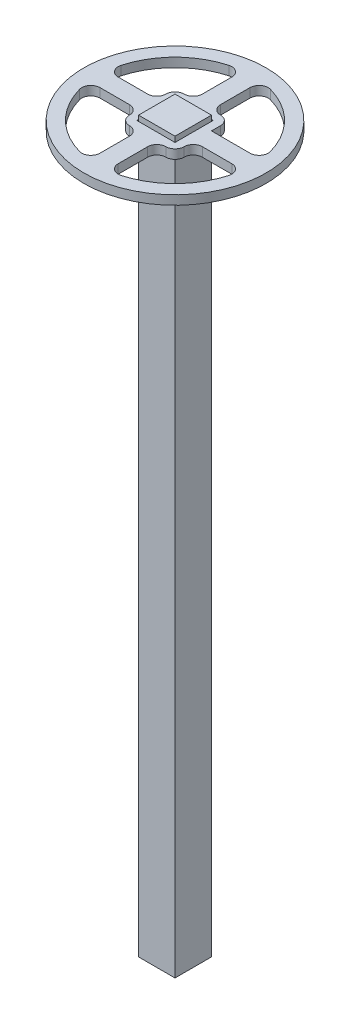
ISO-10303-21;
HEADER;
FILE_DESCRIPTION(('STEP AP214'),'2;1');
FILE_NAME('part.step','',(''),(''),'','','');
FILE_SCHEMA(('AUTOMOTIVE_DESIGN { 1 0 10303 214 1 1 1 1 }'));
ENDSEC;
DATA;
#1=APPLICATION_CONTEXT('core data for automotive mechanical design processes');
#2=APPLICATION_PROTOCOL_DEFINITION('international standard','automotive_design',2000,#1);
#3=PRODUCT_CONTEXT('',#1,'mechanical');
#4=PRODUCT('Part','Part','',(#3));
#5=PRODUCT_RELATED_PRODUCT_CATEGORY('part','',(#4));
#6=PRODUCT_DEFINITION_FORMATION('','',#4);
#7=PRODUCT_DEFINITION_CONTEXT('part definition',#1,'design');
#8=PRODUCT_DEFINITION('design','',#6,#7);
#9=PRODUCT_DEFINITION_SHAPE('','',#8);
#10=(LENGTH_UNIT() NAMED_UNIT(*) SI_UNIT(.MILLI.,.METRE.));
#11=(NAMED_UNIT(*) PLANE_ANGLE_UNIT() SI_UNIT($,.RADIAN.));
#12=(NAMED_UNIT(*) SI_UNIT($,.STERADIAN.) SOLID_ANGLE_UNIT());
#13=UNCERTAINTY_MEASURE_WITH_UNIT(LENGTH_MEASURE(1.E-05),#10,'distance_accuracy_value','');
#14=(GEOMETRIC_REPRESENTATION_CONTEXT(3) GLOBAL_UNCERTAINTY_ASSIGNED_CONTEXT((#13)) GLOBAL_UNIT_ASSIGNED_CONTEXT((#10,
#11,#12)) REPRESENTATION_CONTEXT('',''));
#15=CARTESIAN_POINT('',(0.,0.,0.));
#16=DIRECTION('',(0.,0.,1.));
#17=DIRECTION('',(1.,0.,0.));
#18=AXIS2_PLACEMENT_3D('',#15,#16,#17);
#19=CARTESIAN_POINT('',(0.,795.,0.));
#20=DIRECTION('',(0.,1.,0.));
#21=DIRECTION('',(0.,0.,1.));
#22=AXIS2_PLACEMENT_3D('',#19,#20,#21);
#23=PLANE('',#22);
#24=DIRECTION('',(0.,0.,1.));
#25=VECTOR('',#24,1.);
#26=CARTESIAN_POINT('',(30.,795.,-9.99999999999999));
#27=LINE('',#26,#25);
#28=CARTESIAN_POINT('',(30.,795.,-20.));
#29=VERTEX_POINT('',#28);
#30=CARTESIAN_POINT('',(30.,795.,-9.99999999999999));
#31=VERTEX_POINT('',#30);
#32=EDGE_CURVE('E305',#29,#31,#27,.T.);
#33=ORIENTED_EDGE('',*,*,#32,.F.);
#34=CARTESIAN_POINT('',(20.,795.,-20.));
#35=DIRECTION('',(0.,1.,0.));
#36=DIRECTION('',(0.,0.,1.));
#37=AXIS2_PLACEMENT_3D('',#34,#35,#36);
#38=CIRCLE('',#37,10.);
#39=CARTESIAN_POINT('',(20.,795.,-30.));
#40=VERTEX_POINT('',#39);
#41=EDGE_CURVE('E536',#29,#40,#38,.T.);
#42=ORIENTED_EDGE('',*,*,#41,.T.);
#43=CARTESIAN_POINT('',(20.,795.,-40.));
#44=DIRECTION('',(0.,1.,0.));
#45=DIRECTION('',(0.,0.,1.));
#46=AXIS2_PLACEMENT_3D('',#43,#44,#45);
#47=CIRCLE('',#46,10.);
#48=CARTESIAN_POINT('',(10.,795.,-40.));
#49=VERTEX_POINT('',#48);
#50=EDGE_CURVE('E608',#40,#49,#47,.F.);
#51=ORIENTED_EDGE('',*,*,#50,.T.);
#52=DIRECTION('',(0.,0.,1.));
#53=VECTOR('',#52,1.);
#54=CARTESIAN_POINT('',(10.,795.,-30.));
#55=LINE('',#54,#53);
#56=CARTESIAN_POINT('',(10.,795.,-72.2841614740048));
#57=VERTEX_POINT('',#56);
#58=EDGE_CURVE('E317',#57,#49,#55,.T.);
#59=ORIENTED_EDGE('',*,*,#58,.F.);
#60=CARTESIAN_POINT('',(20.,795.,-72.2841614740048));
#61=DIRECTION('',(0.,1.,0.));
#62=DIRECTION('',(0.,0.,1.));
#63=AXIS2_PLACEMENT_3D('',#60,#61,#62);
#64=CIRCLE('',#63,10.);
#65=CARTESIAN_POINT('',(22.6666666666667,795.,-81.9220496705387));
#66=VERTEX_POINT('',#65);
#67=EDGE_CURVE('E602',#57,#66,#64,.F.);
#68=ORIENTED_EDGE('',*,*,#67,.T.);
#69=CARTESIAN_POINT('',(0.,795.,0.));
#70=DIRECTION('',(0.,1.,0.));
#71=DIRECTION('',(0.,0.,1.));
#72=AXIS2_PLACEMENT_3D('',#69,#70,#71);
#73=CIRCLE('',#72,85.);
#74=CARTESIAN_POINT('',(81.9220496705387,795.,-22.6666666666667));
#75=VERTEX_POINT('',#74);
#76=EDGE_CURVE('E345',#75,#66,#73,.T.);
#77=ORIENTED_EDGE('',*,*,#76,.F.);
#78=CARTESIAN_POINT('',(72.2841614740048,795.,-20.));
#79=DIRECTION('',(0.,1.,0.));
#80=DIRECTION('',(0.,0.,1.));
#81=AXIS2_PLACEMENT_3D('',#78,#79,#80);
#82=CIRCLE('',#81,10.);
#83=CARTESIAN_POINT('',(72.2841614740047,795.,-9.99999999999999));
#84=VERTEX_POINT('',#83);
#85=EDGE_CURVE('E331',#75,#84,#82,.F.);
#86=ORIENTED_EDGE('',*,*,#85,.T.);
#87=DIRECTION('',(1.,0.,0.));
#88=VECTOR('',#87,1.);
#89=CARTESIAN_POINT('',(30.,795.,-9.99999999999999));
#90=LINE('',#89,#88);
#91=EDGE_CURVE('E318',#31,#84,#90,.T.);
#92=ORIENTED_EDGE('',*,*,#91,.F.);
#93=EDGE_LOOP('',(#33,#42,#51,#59,#68,#77,#86,#92));
#94=FACE_BOUND('',#93,.T.);
#95=DIRECTION('',(-1.,0.,0.));
#96=VECTOR('',#95,1.);
#97=CARTESIAN_POINT('',(-30.,795.,10.));
#98=LINE('',#97,#96);
#99=CARTESIAN_POINT('',(-40.,795.,10.));
#100=VERTEX_POINT('',#99);
#101=CARTESIAN_POINT('',(-72.2841614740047,795.,10.));
#102=VERTEX_POINT('',#101);
#103=EDGE_CURVE('E358',#100,#102,#98,.T.);
#104=ORIENTED_EDGE('',*,*,#103,.F.);
#105=CARTESIAN_POINT('',(-40.,795.,20.));
#106=DIRECTION('',(0.,1.,0.));
#107=DIRECTION('',(0.,0.,1.));
#108=AXIS2_PLACEMENT_3D('',#105,#106,#107);
#109=CIRCLE('',#108,10.);
#110=CARTESIAN_POINT('',(-30.,795.,20.));
#111=VERTEX_POINT('',#110);
#112=EDGE_CURVE('E625',#100,#111,#109,.F.);
#113=ORIENTED_EDGE('',*,*,#112,.T.);
#114=CARTESIAN_POINT('',(-20.,795.,20.));
#115=DIRECTION('',(0.,1.,0.));
#116=DIRECTION('',(0.,0.,1.));
#117=AXIS2_PLACEMENT_3D('',#114,#115,#116);
#118=CIRCLE('',#117,10.);
#119=CARTESIAN_POINT('',(-20.,795.,30.));
#120=VERTEX_POINT('',#119);
#121=EDGE_CURVE('E542',#111,#120,#118,.T.);
#122=ORIENTED_EDGE('',*,*,#121,.T.);
#123=CARTESIAN_POINT('',(-19.9999999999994,795.,40.));
#124=DIRECTION('',(0.,1.,0.));
#125=DIRECTION('',(0.,0.,1.));
#126=AXIS2_PLACEMENT_3D('',#123,#124,#125);
#127=CIRCLE('',#126,10.);
#128=CARTESIAN_POINT('',(-9.99999999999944,795.,39.9999999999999));
#129=VERTEX_POINT('',#128);
#130=EDGE_CURVE('E631',#120,#129,#127,.F.);
#131=ORIENTED_EDGE('',*,*,#130,.T.);
#132=DIRECTION('',(0.,0.,-1.));
#133=VECTOR('',#132,1.);
#134=CARTESIAN_POINT('',(-9.99999999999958,795.,30.));
#135=LINE('',#134,#133);
#136=CARTESIAN_POINT('',(-9.99999999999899,795.,72.2841614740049));
#137=VERTEX_POINT('',#136);
#138=EDGE_CURVE('E362',#137,#129,#135,.T.);
#139=ORIENTED_EDGE('',*,*,#138,.F.);
#140=CARTESIAN_POINT('',(-19.999999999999,795.,72.2841614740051));
#141=DIRECTION('',(0.,1.,0.));
#142=DIRECTION('',(0.,0.,1.));
#143=AXIS2_PLACEMENT_3D('',#140,#141,#142);
#144=CIRCLE('',#143,10.);
#145=CARTESIAN_POINT('',(-22.6666666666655,795.,81.9220496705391));
#146=VERTEX_POINT('',#145);
#147=EDGE_CURVE('E573',#137,#146,#144,.F.);
#148=ORIENTED_EDGE('',*,*,#147,.T.);
#149=CARTESIAN_POINT('',(0.,795.,0.));
#150=DIRECTION('',(0.,1.,0.));
#151=DIRECTION('',(0.,0.,1.));
#152=AXIS2_PLACEMENT_3D('',#149,#150,#151);
#153=CIRCLE('',#152,85.);
#154=CARTESIAN_POINT('',(-81.9220496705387,795.,22.6666666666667));
#155=VERTEX_POINT('',#154);
#156=EDGE_CURVE('E327',#155,#146,#153,.T.);
#157=ORIENTED_EDGE('',*,*,#156,.F.);
#158=CARTESIAN_POINT('',(-72.2841614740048,795.,20.));
#159=DIRECTION('',(0.,1.,0.));
#160=DIRECTION('',(0.,0.,1.));
#161=AXIS2_PLACEMENT_3D('',#158,#159,#160);
#162=CIRCLE('',#161,10.);
#163=EDGE_CURVE('E567',#155,#102,#162,.F.);
#164=ORIENTED_EDGE('',*,*,#163,.T.);
#165=EDGE_LOOP('',(#104,#113,#122,#131,#139,#148,#157,#164));
#166=FACE_BOUND('',#165,.T.);
#167=DIRECTION('',(0.,0.,1.));
#168=VECTOR('',#167,1.);
#169=CARTESIAN_POINT('',(10.0000000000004,795.,30.));
#170=LINE('',#169,#168);
#171=CARTESIAN_POINT('',(10.0000000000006,795.,40.0000000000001));
#172=VERTEX_POINT('',#171);
#173=CARTESIAN_POINT('',(10.000000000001,795.,72.2841614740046));
#174=VERTEX_POINT('',#173);
#175=EDGE_CURVE('E696',#172,#174,#170,.T.);
#176=ORIENTED_EDGE('',*,*,#175,.F.);
#177=CARTESIAN_POINT('',(20.0000000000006,795.,40.));
#178=DIRECTION('',(0.,1.,0.));
#179=DIRECTION('',(0.,0.,1.));
#180=AXIS2_PLACEMENT_3D('',#177,#178,#179);
#181=CIRCLE('',#180,10.);
#182=CARTESIAN_POINT('',(20.,795.,30.));
#183=VERTEX_POINT('',#182);
#184=EDGE_CURVE('E637',#172,#183,#181,.F.);
#185=ORIENTED_EDGE('',*,*,#184,.T.);
#186=CARTESIAN_POINT('',(20.,795.,20.));
#187=DIRECTION('',(0.,1.,0.));
#188=DIRECTION('',(0.,0.,1.));
#189=AXIS2_PLACEMENT_3D('',#186,#187,#188);
#190=CIRCLE('',#189,10.);
#191=CARTESIAN_POINT('',(30.,795.,20.));
#192=VERTEX_POINT('',#191);
#193=EDGE_CURVE('E539',#183,#192,#190,.T.);
#194=ORIENTED_EDGE('',*,*,#193,.T.);
#195=CARTESIAN_POINT('',(40.,795.,20.));
#196=DIRECTION('',(0.,1.,0.));
#197=DIRECTION('',(0.,0.,1.));
#198=AXIS2_PLACEMENT_3D('',#195,#196,#197);
#199=CIRCLE('',#198,10.);
#200=CARTESIAN_POINT('',(40.,795.,9.99999999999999));
#201=VERTEX_POINT('',#200);
#202=EDGE_CURVE('E80',#192,#201,#199,.F.);
#203=ORIENTED_EDGE('',*,*,#202,.T.);
#204=DIRECTION('',(-1.,0.,0.));
#205=VECTOR('',#204,1.);
#206=CARTESIAN_POINT('',(30.,795.,9.99999999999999));
#207=LINE('',#206,#205);
#208=CARTESIAN_POINT('',(72.2841614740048,795.,9.99999999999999));
#209=VERTEX_POINT('',#208);
#210=EDGE_CURVE('E689',#209,#201,#207,.T.);
#211=ORIENTED_EDGE('',*,*,#210,.F.);
#212=CARTESIAN_POINT('',(72.2841614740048,795.,20.));
#213=DIRECTION('',(0.,1.,0.));
#214=DIRECTION('',(0.,0.,1.));
#215=AXIS2_PLACEMENT_3D('',#212,#213,#214);
#216=CIRCLE('',#215,10.);
#217=CARTESIAN_POINT('',(81.9220496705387,795.,22.6666666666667));
#218=VERTEX_POINT('',#217);
#219=EDGE_CURVE('E585',#209,#218,#216,.F.);
#220=ORIENTED_EDGE('',*,*,#219,.T.);
#221=CARTESIAN_POINT('',(0.,795.,0.));
#222=DIRECTION('',(0.,1.,0.));
#223=DIRECTION('',(0.,0.,1.));
#224=AXIS2_PLACEMENT_3D('',#221,#222,#223);
#225=CIRCLE('',#224,85.);
#226=CARTESIAN_POINT('',(22.6666666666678,795.,81.9220496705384));
#227=VERTEX_POINT('',#226);
#228=EDGE_CURVE('E375',#227,#218,#225,.T.);
#229=ORIENTED_EDGE('',*,*,#228,.F.);
#230=CARTESIAN_POINT('',(20.000000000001,795.,72.2841614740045));
#231=DIRECTION('',(0.,1.,0.));
#232=DIRECTION('',(0.,0.,1.));
#233=AXIS2_PLACEMENT_3D('',#230,#231,#232);
#234=CIRCLE('',#233,10.);
#235=EDGE_CURVE('E579',#227,#174,#234,.F.);
#236=ORIENTED_EDGE('',*,*,#235,.T.);
#237=EDGE_LOOP('',(#176,#185,#194,#203,#211,#220,#229,#236));
#238=FACE_BOUND('',#237,.T.);
#239=DIRECTION('',(0.,0.,-1.));
#240=VECTOR('',#239,1.);
#241=CARTESIAN_POINT('',(-9.99999999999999,795.,-30.));
#242=LINE('',#241,#240);
#243=CARTESIAN_POINT('',(-9.99999999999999,795.,-40.));
#244=VERTEX_POINT('',#243);
#245=CARTESIAN_POINT('',(-10.,795.,-72.2841614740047));
#246=VERTEX_POINT('',#245);
#247=EDGE_CURVE('E387',#244,#246,#242,.T.);
#248=ORIENTED_EDGE('',*,*,#247,.F.);
#249=CARTESIAN_POINT('',(-20.,795.,-40.));
#250=DIRECTION('',(0.,1.,0.));
#251=DIRECTION('',(0.,0.,1.));
#252=AXIS2_PLACEMENT_3D('',#249,#250,#251);
#253=CIRCLE('',#252,10.);
#254=CARTESIAN_POINT('',(-20.,795.,-30.));
#255=VERTEX_POINT('',#254);
#256=EDGE_CURVE('E614',#244,#255,#253,.F.);
#257=ORIENTED_EDGE('',*,*,#256,.T.);
#258=CARTESIAN_POINT('',(-20.,795.,-20.));
#259=DIRECTION('',(0.,1.,0.));
#260=DIRECTION('',(0.,0.,1.));
#261=AXIS2_PLACEMENT_3D('',#258,#259,#260);
#262=CIRCLE('',#261,10.);
#263=CARTESIAN_POINT('',(-30.,795.,-20.));
#264=VERTEX_POINT('',#263);
#265=EDGE_CURVE('E545',#255,#264,#262,.T.);
#266=ORIENTED_EDGE('',*,*,#265,.T.);
#267=CARTESIAN_POINT('',(-40.,795.,-20.));
#268=DIRECTION('',(0.,1.,0.));
#269=DIRECTION('',(0.,0.,1.));
#270=AXIS2_PLACEMENT_3D('',#267,#268,#269);
#271=CIRCLE('',#270,10.);
#272=CARTESIAN_POINT('',(-40.,795.,-10.));
#273=VERTEX_POINT('',#272);
#274=EDGE_CURVE('E620',#264,#273,#271,.F.);
#275=ORIENTED_EDGE('',*,*,#274,.T.);
#276=DIRECTION('',(1.,0.,0.));
#277=VECTOR('',#276,1.);
#278=CARTESIAN_POINT('',(-30.,795.,-10.));
#279=LINE('',#278,#277);
#280=CARTESIAN_POINT('',(-72.2841614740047,795.,-10.));
#281=VERTEX_POINT('',#280);
#282=EDGE_CURVE('E398',#281,#273,#279,.T.);
#283=ORIENTED_EDGE('',*,*,#282,.F.);
#284=CARTESIAN_POINT('',(-72.2841614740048,795.,-20.));
#285=DIRECTION('',(0.,1.,0.));
#286=DIRECTION('',(0.,0.,1.));
#287=AXIS2_PLACEMENT_3D('',#284,#285,#286);
#288=CIRCLE('',#287,10.);
#289=CARTESIAN_POINT('',(-81.9220496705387,795.,-22.6666666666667));
#290=VERTEX_POINT('',#289);
#291=EDGE_CURVE('E561',#281,#290,#288,.F.);
#292=ORIENTED_EDGE('',*,*,#291,.T.);
#293=CARTESIAN_POINT('',(0.,795.,0.));
#294=DIRECTION('',(0.,1.,0.));
#295=DIRECTION('',(0.,0.,1.));
#296=AXIS2_PLACEMENT_3D('',#293,#294,#295);
#297=CIRCLE('',#296,85.);
#298=CARTESIAN_POINT('',(-22.6666666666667,795.,-81.9220496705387));
#299=VERTEX_POINT('',#298);
#300=EDGE_CURVE('E349',#299,#290,#297,.T.);
#301=ORIENTED_EDGE('',*,*,#300,.F.);
#302=CARTESIAN_POINT('',(-20.,795.,-72.2841614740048));
#303=DIRECTION('',(0.,1.,0.));
#304=DIRECTION('',(0.,0.,1.));
#305=AXIS2_PLACEMENT_3D('',#302,#303,#304);
#306=CIRCLE('',#305,10.);
#307=EDGE_CURVE('E596',#299,#246,#306,.F.);
#308=ORIENTED_EDGE('',*,*,#307,.T.);
#309=EDGE_LOOP('',(#248,#257,#266,#275,#283,#292,#301,#308));
#310=FACE_BOUND('',#309,.T.);
#311=CARTESIAN_POINT('',(0.,795.,0.));
#312=DIRECTION('',(0.,1.,0.));
#313=DIRECTION('',(0.,0.,1.));
#314=AXIS2_PLACEMENT_3D('',#311,#312,#313);
#315=CIRCLE('',#314,100.);
#316=CARTESIAN_POINT('',(0.,795.,100.));
#317=VERTEX_POINT('',#316);
#318=EDGE_CURVE('E448',#317,#317,#315,.T.);
#319=ORIENTED_EDGE('',*,*,#318,.T.);
#320=EDGE_LOOP('',(#319));
#321=FACE_BOUND('',#320,.T.);
#322=DIRECTION('',(-1.,0.,0.));
#323=VECTOR('',#322,1.);
#324=CARTESIAN_POINT('',(21.,795.,-21.));
#325=LINE('',#324,#323);
#326=CARTESIAN_POINT('',(21.,795.,-21.));
#327=VERTEX_POINT('',#326);
#328=CARTESIAN_POINT('',(-21.,795.,-21.));
#329=VERTEX_POINT('',#328);
#330=EDGE_CURVE('E408',#327,#329,#325,.T.);
#331=ORIENTED_EDGE('',*,*,#330,.F.);
#332=DIRECTION('',(0.,0.,-1.));
#333=VECTOR('',#332,1.);
#334=CARTESIAN_POINT('',(21.,795.,21.));
#335=LINE('',#334,#333);
#336=CARTESIAN_POINT('',(21.,795.,21.));
#337=VERTEX_POINT('',#336);
#338=EDGE_CURVE('E405',#337,#327,#335,.T.);
#339=ORIENTED_EDGE('',*,*,#338,.F.);
#340=DIRECTION('',(1.,0.,0.));
#341=VECTOR('',#340,1.);
#342=CARTESIAN_POINT('',(-21.,795.,21.));
#343=LINE('',#342,#341);
#344=CARTESIAN_POINT('',(-21.,795.,21.));
#345=VERTEX_POINT('',#344);
#346=EDGE_CURVE('E416',#345,#337,#343,.T.);
#347=ORIENTED_EDGE('',*,*,#346,.F.);
#348=DIRECTION('',(0.,0.,1.));
#349=VECTOR('',#348,1.);
#350=CARTESIAN_POINT('',(-21.,795.,-21.));
#351=LINE('',#350,#349);
#352=EDGE_CURVE('E412',#329,#345,#351,.T.);
#353=ORIENTED_EDGE('',*,*,#352,.F.);
#354=EDGE_LOOP('',(#331,#339,#347,#353));
#355=FACE_BOUND('',#354,.T.);
#356=ADVANCED_FACE('F70',(#94,#166,#238,#310,#321,#355),#23,.T.);
#357=CARTESIAN_POINT('',(0.,785.,0.));
#358=DIRECTION('',(0.,1.,0.));
#359=DIRECTION('',(0.,0.,1.));
#360=AXIS2_PLACEMENT_3D('',#357,#358,#359);
#361=PLANE('',#360);
#362=DIRECTION('',(0.,0.,1.));
#363=VECTOR('',#362,1.);
#364=CARTESIAN_POINT('',(10.,785.,-30.));
#365=LINE('',#364,#363);
#366=CARTESIAN_POINT('',(10.,785.,-72.2841614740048));
#367=VERTEX_POINT('',#366);
#368=CARTESIAN_POINT('',(10.,785.,-40.));
#369=VERTEX_POINT('',#368);
#370=EDGE_CURVE('E338',#367,#369,#365,.T.);
#371=ORIENTED_EDGE('',*,*,#370,.T.);
#372=CARTESIAN_POINT('',(20.,785.,-40.));
#373=DIRECTION('',(0.,1.,0.));
#374=DIRECTION('',(0.,0.,1.));
#375=AXIS2_PLACEMENT_3D('',#372,#373,#374);
#376=CIRCLE('',#375,10.);
#377=CARTESIAN_POINT('',(20.,785.,-30.));
#378=VERTEX_POINT('',#377);
#379=EDGE_CURVE('E611',#369,#378,#376,.T.);
#380=ORIENTED_EDGE('',*,*,#379,.T.);
#381=CARTESIAN_POINT('',(20.,785.,-20.));
#382=DIRECTION('',(0.,1.,0.));
#383=DIRECTION('',(0.,0.,1.));
#384=AXIS2_PLACEMENT_3D('',#381,#382,#383);
#385=CIRCLE('',#384,10.);
#386=CARTESIAN_POINT('',(30.,785.,-20.));
#387=VERTEX_POINT('',#386);
#388=EDGE_CURVE('E548',#378,#387,#385,.F.);
#389=ORIENTED_EDGE('',*,*,#388,.T.);
#390=DIRECTION('',(0.,0.,1.));
#391=VECTOR('',#390,1.);
#392=CARTESIAN_POINT('',(30.,785.,-9.99999999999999));
#393=LINE('',#392,#391);
#394=CARTESIAN_POINT('',(30.,785.,-9.99999999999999));
#395=VERTEX_POINT('',#394);
#396=EDGE_CURVE('E352',#387,#395,#393,.T.);
#397=ORIENTED_EDGE('',*,*,#396,.T.);
#398=DIRECTION('',(1.,0.,0.));
#399=VECTOR('',#398,1.);
#400=CARTESIAN_POINT('',(30.,785.,-9.99999999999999));
#401=LINE('',#400,#399);
#402=CARTESIAN_POINT('',(72.2841614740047,785.,-9.99999999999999));
#403=VERTEX_POINT('',#402);
#404=EDGE_CURVE('E325',#395,#403,#401,.T.);
#405=ORIENTED_EDGE('',*,*,#404,.T.);
#406=CARTESIAN_POINT('',(72.2841614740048,785.,-20.));
#407=DIRECTION('',(0.,1.,0.));
#408=DIRECTION('',(0.,0.,1.));
#409=AXIS2_PLACEMENT_3D('',#406,#407,#408);
#410=CIRCLE('',#409,10.);
#411=CARTESIAN_POINT('',(81.9220496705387,785.,-22.6666666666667));
#412=VERTEX_POINT('',#411);
#413=EDGE_CURVE('E593',#403,#412,#410,.T.);
#414=ORIENTED_EDGE('',*,*,#413,.T.);
#415=CARTESIAN_POINT('',(0.,785.,0.));
#416=DIRECTION('',(0.,1.,0.));
#417=DIRECTION('',(0.,0.,1.));
#418=AXIS2_PLACEMENT_3D('',#415,#416,#417);
#419=CIRCLE('',#418,85.);
#420=CARTESIAN_POINT('',(22.6666666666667,785.,-81.9220496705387));
#421=VERTEX_POINT('',#420);
#422=EDGE_CURVE('E333',#412,#421,#419,.T.);
#423=ORIENTED_EDGE('',*,*,#422,.T.);
#424=CARTESIAN_POINT('',(20.,785.,-72.2841614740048));
#425=DIRECTION('',(0.,1.,0.));
#426=DIRECTION('',(0.,0.,1.));
#427=AXIS2_PLACEMENT_3D('',#424,#425,#426);
#428=CIRCLE('',#427,10.);
#429=EDGE_CURVE('E605',#421,#367,#428,.T.);
#430=ORIENTED_EDGE('',*,*,#429,.T.);
#431=EDGE_LOOP('',(#371,#380,#389,#397,#405,#414,#423,#430));
#432=FACE_BOUND('',#431,.T.);
#433=DIRECTION('',(0.,0.,-1.));
#434=VECTOR('',#433,1.);
#435=CARTESIAN_POINT('',(-9.99999999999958,785.,30.));
#436=LINE('',#435,#434);
#437=CARTESIAN_POINT('',(-9.99999999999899,785.,72.2841614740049));
#438=VERTEX_POINT('',#437);
#439=CARTESIAN_POINT('',(-9.99999999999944,785.,39.9999999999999));
#440=VERTEX_POINT('',#439);
#441=EDGE_CURVE('E374',#438,#440,#436,.T.);
#442=ORIENTED_EDGE('',*,*,#441,.T.);
#443=CARTESIAN_POINT('',(-19.9999999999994,785.,40.));
#444=DIRECTION('',(0.,1.,0.));
#445=DIRECTION('',(0.,0.,1.));
#446=AXIS2_PLACEMENT_3D('',#443,#444,#445);
#447=CIRCLE('',#446,10.);
#448=CARTESIAN_POINT('',(-20.,785.,30.));
#449=VERTEX_POINT('',#448);
#450=EDGE_CURVE('E634',#440,#449,#447,.T.);
#451=ORIENTED_EDGE('',*,*,#450,.T.);
#452=CARTESIAN_POINT('',(-20.,785.,20.));
#453=DIRECTION('',(0.,1.,0.));
#454=DIRECTION('',(0.,0.,1.));
#455=AXIS2_PLACEMENT_3D('',#452,#453,#454);
#456=CIRCLE('',#455,10.);
#457=CARTESIAN_POINT('',(-30.,785.,20.));
#458=VERTEX_POINT('',#457);
#459=EDGE_CURVE('E554',#449,#458,#456,.F.);
#460=ORIENTED_EDGE('',*,*,#459,.T.);
#461=CARTESIAN_POINT('',(-40.,785.,20.));
#462=DIRECTION('',(0.,1.,0.));
#463=DIRECTION('',(0.,0.,1.));
#464=AXIS2_PLACEMENT_3D('',#461,#462,#463);
#465=CIRCLE('',#464,10.);
#466=CARTESIAN_POINT('',(-40.,785.,10.));
#467=VERTEX_POINT('',#466);
#468=EDGE_CURVE('E628',#458,#467,#465,.T.);
#469=ORIENTED_EDGE('',*,*,#468,.T.);
#470=DIRECTION('',(-1.,0.,0.));
#471=VECTOR('',#470,1.);
#472=CARTESIAN_POINT('',(-30.,785.,10.));
#473=LINE('',#472,#471);
#474=CARTESIAN_POINT('',(-72.2841614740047,785.,10.));
#475=VERTEX_POINT('',#474);
#476=EDGE_CURVE('E370',#467,#475,#473,.T.);
#477=ORIENTED_EDGE('',*,*,#476,.T.);
#478=CARTESIAN_POINT('',(-72.2841614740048,785.,20.));
#479=DIRECTION('',(0.,1.,0.));
#480=DIRECTION('',(0.,0.,1.));
#481=AXIS2_PLACEMENT_3D('',#478,#479,#480);
#482=CIRCLE('',#481,10.);
#483=CARTESIAN_POINT('',(-81.9220496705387,785.,22.6666666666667));
#484=VERTEX_POINT('',#483);
#485=EDGE_CURVE('E570',#475,#484,#482,.T.);
#486=ORIENTED_EDGE('',*,*,#485,.T.);
#487=CARTESIAN_POINT('',(0.,785.,0.));
#488=DIRECTION('',(0.,1.,0.));
#489=DIRECTION('',(0.,0.,1.));
#490=AXIS2_PLACEMENT_3D('',#487,#488,#489);
#491=CIRCLE('',#490,85.);
#492=CARTESIAN_POINT('',(-22.6666666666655,785.,81.9220496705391));
#493=VERTEX_POINT('',#492);
#494=EDGE_CURVE('E363',#484,#493,#491,.T.);
#495=ORIENTED_EDGE('',*,*,#494,.T.);
#496=CARTESIAN_POINT('',(-19.999999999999,785.,72.2841614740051));
#497=DIRECTION('',(0.,1.,0.));
#498=DIRECTION('',(0.,0.,1.));
#499=AXIS2_PLACEMENT_3D('',#496,#497,#498);
#500=CIRCLE('',#499,10.);
#501=EDGE_CURVE('E576',#493,#438,#500,.T.);
#502=ORIENTED_EDGE('',*,*,#501,.T.);
#503=EDGE_LOOP('',(#442,#451,#460,#469,#477,#486,#495,#502));
#504=FACE_BOUND('',#503,.T.);
#505=DIRECTION('',(-1.,0.,0.));
#506=VECTOR('',#505,1.);
#507=CARTESIAN_POINT('',(30.,785.,9.99999999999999));
#508=LINE('',#507,#506);
#509=CARTESIAN_POINT('',(72.2841614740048,785.,9.99999999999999));
#510=VERTEX_POINT('',#509);
#511=CARTESIAN_POINT('',(40.,785.,9.99999999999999));
#512=VERTEX_POINT('',#511);
#513=EDGE_CURVE('E710',#510,#512,#508,.T.);
#514=ORIENTED_EDGE('',*,*,#513,.T.);
#515=CARTESIAN_POINT('',(40.,785.,20.));
#516=DIRECTION('',(0.,1.,0.));
#517=DIRECTION('',(0.,0.,1.));
#518=AXIS2_PLACEMENT_3D('',#515,#516,#517);
#519=CIRCLE('',#518,10.);
#520=CARTESIAN_POINT('',(30.,785.,20.));
#521=VERTEX_POINT('',#520);
#522=EDGE_CURVE('E13',#512,#521,#519,.T.);
#523=ORIENTED_EDGE('',*,*,#522,.T.);
#524=CARTESIAN_POINT('',(20.,785.,20.));
#525=DIRECTION('',(0.,1.,0.));
#526=DIRECTION('',(0.,0.,1.));
#527=AXIS2_PLACEMENT_3D('',#524,#525,#526);
#528=CIRCLE('',#527,10.);
#529=CARTESIAN_POINT('',(20.,785.,30.));
#530=VERTEX_POINT('',#529);
#531=EDGE_CURVE('E551',#521,#530,#528,.F.);
#532=ORIENTED_EDGE('',*,*,#531,.T.);
#533=CARTESIAN_POINT('',(20.0000000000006,785.,40.));
#534=DIRECTION('',(0.,1.,0.));
#535=DIRECTION('',(0.,0.,1.));
#536=AXIS2_PLACEMENT_3D('',#533,#534,#535);
#537=CIRCLE('',#536,10.);
#538=CARTESIAN_POINT('',(10.0000000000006,785.,40.0000000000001));
#539=VERTEX_POINT('',#538);
#540=EDGE_CURVE('E640',#530,#539,#537,.T.);
#541=ORIENTED_EDGE('',*,*,#540,.T.);
#542=DIRECTION('',(0.,0.,1.));
#543=VECTOR('',#542,1.);
#544=CARTESIAN_POINT('',(10.0000000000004,785.,30.));
#545=LINE('',#544,#543);
#546=CARTESIAN_POINT('',(10.000000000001,785.,72.2841614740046));
#547=VERTEX_POINT('',#546);
#548=EDGE_CURVE('E649',#539,#547,#545,.T.);
#549=ORIENTED_EDGE('',*,*,#548,.T.);
#550=CARTESIAN_POINT('',(20.000000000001,785.,72.2841614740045));
#551=DIRECTION('',(0.,1.,0.));
#552=DIRECTION('',(0.,0.,1.));
#553=AXIS2_PLACEMENT_3D('',#550,#551,#552);
#554=CIRCLE('',#553,10.);
#555=CARTESIAN_POINT('',(22.6666666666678,785.,81.9220496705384));
#556=VERTEX_POINT('',#555);
#557=EDGE_CURVE('E582',#547,#556,#554,.T.);
#558=ORIENTED_EDGE('',*,*,#557,.T.);
#559=CARTESIAN_POINT('',(0.,785.,0.));
#560=DIRECTION('',(0.,1.,0.));
#561=DIRECTION('',(0.,0.,1.));
#562=AXIS2_PLACEMENT_3D('',#559,#560,#561);
#563=CIRCLE('',#562,85.);
#564=CARTESIAN_POINT('',(81.9220496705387,785.,22.6666666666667));
#565=VERTEX_POINT('',#564);
#566=EDGE_CURVE('E704',#556,#565,#563,.T.);
#567=ORIENTED_EDGE('',*,*,#566,.T.);
#568=CARTESIAN_POINT('',(72.2841614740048,785.,20.));
#569=DIRECTION('',(0.,1.,0.));
#570=DIRECTION('',(0.,0.,1.));
#571=AXIS2_PLACEMENT_3D('',#568,#569,#570);
#572=CIRCLE('',#571,10.);
#573=EDGE_CURVE('E588',#565,#510,#572,.T.);
#574=ORIENTED_EDGE('',*,*,#573,.T.);
#575=EDGE_LOOP('',(#514,#523,#532,#541,#549,#558,#567,#574));
#576=FACE_BOUND('',#575,.T.);
#577=DIRECTION('',(1.,0.,0.));
#578=VECTOR('',#577,1.);
#579=CARTESIAN_POINT('',(-30.,785.,-10.));
#580=LINE('',#579,#578);
#581=CARTESIAN_POINT('',(-72.2841614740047,785.,-10.));
#582=VERTEX_POINT('',#581);
#583=CARTESIAN_POINT('',(-40.,785.,-10.));
#584=VERTEX_POINT('',#583);
#585=EDGE_CURVE('E386',#582,#584,#580,.T.);
#586=ORIENTED_EDGE('',*,*,#585,.T.);
#587=CARTESIAN_POINT('',(-40.,785.,-20.));
#588=DIRECTION('',(0.,1.,0.));
#589=DIRECTION('',(0.,0.,1.));
#590=AXIS2_PLACEMENT_3D('',#587,#588,#589);
#591=CIRCLE('',#590,10.);
#592=CARTESIAN_POINT('',(-30.,785.,-20.));
#593=VERTEX_POINT('',#592);
#594=EDGE_CURVE('E93',#584,#593,#591,.T.);
#595=ORIENTED_EDGE('',*,*,#594,.T.);
#596=CARTESIAN_POINT('',(-20.,785.,-20.));
#597=DIRECTION('',(0.,1.,0.));
#598=DIRECTION('',(0.,0.,1.));
#599=AXIS2_PLACEMENT_3D('',#596,#597,#598);
#600=CIRCLE('',#599,10.);
#601=CARTESIAN_POINT('',(-20.,785.,-30.));
#602=VERTEX_POINT('',#601);
#603=EDGE_CURVE('E88',#593,#602,#600,.F.);
#604=ORIENTED_EDGE('',*,*,#603,.T.);
#605=CARTESIAN_POINT('',(-20.,785.,-40.));
#606=DIRECTION('',(0.,1.,0.));
#607=DIRECTION('',(0.,0.,1.));
#608=AXIS2_PLACEMENT_3D('',#605,#606,#607);
#609=CIRCLE('',#608,10.);
#610=CARTESIAN_POINT('',(-9.99999999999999,785.,-40.));
#611=VERTEX_POINT('',#610);
#612=EDGE_CURVE('E617',#602,#611,#609,.T.);
#613=ORIENTED_EDGE('',*,*,#612,.T.);
#614=DIRECTION('',(0.,0.,-1.));
#615=VECTOR('',#614,1.);
#616=CARTESIAN_POINT('',(-9.99999999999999,785.,-30.));
#617=LINE('',#616,#615);
#618=CARTESIAN_POINT('',(-10.,785.,-72.2841614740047));
#619=VERTEX_POINT('',#618);
#620=EDGE_CURVE('E390',#611,#619,#617,.T.);
#621=ORIENTED_EDGE('',*,*,#620,.T.);
#622=CARTESIAN_POINT('',(-20.,785.,-72.2841614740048));
#623=DIRECTION('',(0.,1.,0.));
#624=DIRECTION('',(0.,0.,1.));
#625=AXIS2_PLACEMENT_3D('',#622,#623,#624);
#626=CIRCLE('',#625,10.);
#627=CARTESIAN_POINT('',(-22.6666666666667,785.,-81.9220496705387));
#628=VERTEX_POINT('',#627);
#629=EDGE_CURVE('E599',#619,#628,#626,.T.);
#630=ORIENTED_EDGE('',*,*,#629,.T.);
#631=CARTESIAN_POINT('',(0.,785.,0.));
#632=DIRECTION('',(0.,1.,0.));
#633=DIRECTION('',(0.,0.,1.));
#634=AXIS2_PLACEMENT_3D('',#631,#632,#633);
#635=CIRCLE('',#634,85.);
#636=CARTESIAN_POINT('',(-81.9220496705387,785.,-22.6666666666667));
#637=VERTEX_POINT('',#636);
#638=EDGE_CURVE('E382',#628,#637,#635,.T.);
#639=ORIENTED_EDGE('',*,*,#638,.T.);
#640=CARTESIAN_POINT('',(-72.2841614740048,785.,-20.));
#641=DIRECTION('',(0.,1.,0.));
#642=DIRECTION('',(0.,0.,1.));
#643=AXIS2_PLACEMENT_3D('',#640,#641,#642);
#644=CIRCLE('',#643,10.);
#645=EDGE_CURVE('E564',#637,#582,#644,.T.);
#646=ORIENTED_EDGE('',*,*,#645,.T.);
#647=EDGE_LOOP('',(#586,#595,#604,#613,#621,#630,#639,#646));
#648=FACE_BOUND('',#647,.T.);
#649=CARTESIAN_POINT('',(0.,785.,0.));
#650=DIRECTION('',(0.,1.,0.));
#651=DIRECTION('',(0.,0.,1.));
#652=AXIS2_PLACEMENT_3D('',#649,#650,#651);
#653=CIRCLE('',#652,100.);
#654=CARTESIAN_POINT('',(0.,785.,100.));
#655=VERTEX_POINT('',#654);
#656=EDGE_CURVE('E447',#655,#655,#653,.T.);
#657=ORIENTED_EDGE('',*,*,#656,.F.);
#658=EDGE_LOOP('',(#657));
#659=FACE_BOUND('',#658,.T.);
#660=DIRECTION('',(0.,0.,-1.));
#661=VECTOR('',#660,1.);
#662=CARTESIAN_POINT('',(21.,785.,21.));
#663=LINE('',#662,#661);
#664=CARTESIAN_POINT('',(21.,785.,21.));
#665=VERTEX_POINT('',#664);
#666=CARTESIAN_POINT('',(21.,785.,-21.));
#667=VERTEX_POINT('',#666);
#668=EDGE_CURVE('E394',#665,#667,#663,.T.);
#669=ORIENTED_EDGE('',*,*,#668,.T.);
#670=DIRECTION('',(-1.,0.,0.));
#671=VECTOR('',#670,1.);
#672=CARTESIAN_POINT('',(21.,785.,-21.));
#673=LINE('',#672,#671);
#674=CARTESIAN_POINT('',(-21.,785.,-21.));
#675=VERTEX_POINT('',#674);
#676=EDGE_CURVE('E423',#667,#675,#673,.T.);
#677=ORIENTED_EDGE('',*,*,#676,.T.);
#678=DIRECTION('',(0.,0.,1.));
#679=VECTOR('',#678,1.);
#680=CARTESIAN_POINT('',(-21.,785.,-21.));
#681=LINE('',#680,#679);
#682=CARTESIAN_POINT('',(-21.,785.,21.));
#683=VERTEX_POINT('',#682);
#684=EDGE_CURVE('E427',#675,#683,#681,.T.);
#685=ORIENTED_EDGE('',*,*,#684,.T.);
#686=DIRECTION('',(1.,0.,0.));
#687=VECTOR('',#686,1.);
#688=CARTESIAN_POINT('',(-21.,785.,21.));
#689=LINE('',#688,#687);
#690=EDGE_CURVE('E409',#683,#665,#689,.T.);
#691=ORIENTED_EDGE('',*,*,#690,.T.);
#692=EDGE_LOOP('',(#669,#677,#685,#691));
#693=FACE_BOUND('',#692,.T.);
#694=ADVANCED_FACE('F718',(#432,#504,#576,#648,#659,#693),#361,.F.);
#695=CARTESIAN_POINT('',(0.,795.,0.));
#696=DIRECTION('',(0.,-1.,0.));
#697=DIRECTION('',(0.,0.,-1.));
#698=AXIS2_PLACEMENT_3D('',#695,#696,#697);
#699=CYLINDRICAL_SURFACE('',#698,100.);
#700=ORIENTED_EDGE('',*,*,#318,.F.);
#701=EDGE_LOOP('',(#700));
#702=FACE_BOUND('',#701,.T.);
#703=ORIENTED_EDGE('',*,*,#656,.T.);
#704=EDGE_LOOP('',(#703));
#705=FACE_BOUND('',#704,.T.);
#706=ADVANCED_FACE('F747',(#702,#705),#699,.T.);
#707=CARTESIAN_POINT('',(21.,795.,21.));
#708=DIRECTION('',(-1.,0.,0.));
#709=DIRECTION('',(0.,0.,1.));
#710=AXIS2_PLACEMENT_3D('',#707,#708,#709);
#711=PLANE('',#710);
#712=ORIENTED_EDGE('',*,*,#668,.F.);
#713=DIRECTION('',(0.,-1.,0.));
#714=VECTOR('',#713,1.);
#715=CARTESIAN_POINT('',(21.,795.,21.));
#716=LINE('',#715,#714);
#717=EDGE_CURVE('E419',#337,#665,#716,.T.);
#718=ORIENTED_EDGE('',*,*,#717,.F.);
#719=ORIENTED_EDGE('',*,*,#338,.T.);
#720=DIRECTION('',(0.,-1.,0.));
#721=VECTOR('',#720,1.);
#722=CARTESIAN_POINT('',(21.,795.,-21.));
#723=LINE('',#722,#721);
#724=EDGE_CURVE('E443',#327,#667,#723,.T.);
#725=ORIENTED_EDGE('',*,*,#724,.T.);
#726=EDGE_LOOP('',(#712,#718,#719,#725));
#727=FACE_BOUND('',#726,.T.);
#728=ADVANCED_FACE('F751',(#727),#711,.T.);
#729=CARTESIAN_POINT('',(21.,795.,-21.));
#730=DIRECTION('',(0.,0.,1.));
#731=DIRECTION('',(1.,0.,0.));
#732=AXIS2_PLACEMENT_3D('',#729,#730,#731);
#733=PLANE('',#732);
#734=ORIENTED_EDGE('',*,*,#676,.F.);
#735=ORIENTED_EDGE('',*,*,#724,.F.);
#736=ORIENTED_EDGE('',*,*,#330,.T.);
#737=DIRECTION('',(0.,-1.,0.));
#738=VECTOR('',#737,1.);
#739=CARTESIAN_POINT('',(-21.,795.,-21.));
#740=LINE('',#739,#738);
#741=EDGE_CURVE('E440',#329,#675,#740,.T.);
#742=ORIENTED_EDGE('',*,*,#741,.T.);
#743=EDGE_LOOP('',(#734,#735,#736,#742));
#744=FACE_BOUND('',#743,.T.);
#745=ADVANCED_FACE('F877',(#744),#733,.T.);
#746=CARTESIAN_POINT('',(-21.,795.,-21.));
#747=DIRECTION('',(1.,0.,0.));
#748=DIRECTION('',(0.,0.,-1.));
#749=AXIS2_PLACEMENT_3D('',#746,#747,#748);
#750=PLANE('',#749);
#751=ORIENTED_EDGE('',*,*,#684,.F.);
#752=ORIENTED_EDGE('',*,*,#741,.F.);
#753=ORIENTED_EDGE('',*,*,#352,.T.);
#754=DIRECTION('',(0.,-1.,0.));
#755=VECTOR('',#754,1.);
#756=CARTESIAN_POINT('',(-21.,795.,21.));
#757=LINE('',#756,#755);
#758=EDGE_CURVE('E437',#345,#683,#757,.T.);
#759=ORIENTED_EDGE('',*,*,#758,.T.);
#760=EDGE_LOOP('',(#751,#752,#753,#759));
#761=FACE_BOUND('',#760,.T.);
#762=ADVANCED_FACE('F874',(#761),#750,.T.);
#763=CARTESIAN_POINT('',(-21.,795.,21.));
#764=DIRECTION('',(0.,0.,-1.));
#765=DIRECTION('',(-1.,0.,0.));
#766=AXIS2_PLACEMENT_3D('',#763,#764,#765);
#767=PLANE('',#766);
#768=ORIENTED_EDGE('',*,*,#690,.F.);
#769=ORIENTED_EDGE('',*,*,#758,.F.);
#770=ORIENTED_EDGE('',*,*,#346,.T.);
#771=ORIENTED_EDGE('',*,*,#717,.T.);
#772=EDGE_LOOP('',(#768,#769,#770,#771));
#773=FACE_BOUND('',#772,.T.);
#774=ADVANCED_FACE('F871',(#773),#767,.T.);
#775=CARTESIAN_POINT('',(0.,785.,0.));
#776=DIRECTION('',(0.,1.,0.));
#777=DIRECTION('',(0.,0.,1.));
#778=AXIS2_PLACEMENT_3D('',#775,#776,#777);
#779=CYLINDRICAL_SURFACE('',#778,85.);
#780=ORIENTED_EDGE('',*,*,#300,.T.);
#781=DIRECTION('',(0.,1.,0.));
#782=VECTOR('',#781,1.);
#783=CARTESIAN_POINT('',(-81.9220496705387,785.,-22.6666666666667));
#784=LINE('',#783,#782);
#785=EDGE_CURVE('E466',#290,#637,#784,.F.);
#786=ORIENTED_EDGE('',*,*,#785,.T.);
#787=ORIENTED_EDGE('',*,*,#638,.F.);
#788=DIRECTION('',(0.,1.,0.));
#789=VECTOR('',#788,1.);
#790=CARTESIAN_POINT('',(-22.6666666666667,785.,-81.9220496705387));
#791=LINE('',#790,#789);
#792=EDGE_CURVE('E462',#628,#299,#791,.T.);
#793=ORIENTED_EDGE('',*,*,#792,.T.);
#794=EDGE_LOOP('',(#780,#786,#787,#793));
#795=FACE_BOUND('',#794,.T.);
#796=ADVANCED_FACE('F864',(#795),#779,.F.);
#797=CARTESIAN_POINT('',(-9.99999999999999,785.,-30.));
#798=DIRECTION('',(1.,0.,0.));
#799=DIRECTION('',(0.,0.,-1.));
#800=AXIS2_PLACEMENT_3D('',#797,#798,#799);
#801=PLANE('',#800);
#802=ORIENTED_EDGE('',*,*,#247,.T.);
#803=DIRECTION('',(0.,-1.,0.));
#804=VECTOR('',#803,1.);
#805=CARTESIAN_POINT('',(-10.,785.,-72.2841614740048));
#806=LINE('',#805,#804);
#807=EDGE_CURVE('E525',#246,#619,#806,.T.);
#808=ORIENTED_EDGE('',*,*,#807,.T.);
#809=ORIENTED_EDGE('',*,*,#620,.F.);
#810=DIRECTION('',(0.,1.,0.));
#811=VECTOR('',#810,1.);
#812=CARTESIAN_POINT('',(-9.99999999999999,795.,-40.));
#813=LINE('',#812,#811);
#814=EDGE_CURVE('E521',#611,#244,#813,.T.);
#815=ORIENTED_EDGE('',*,*,#814,.T.);
#816=EDGE_LOOP('',(#802,#808,#809,#815));
#817=FACE_BOUND('',#816,.T.);
#818=ADVANCED_FACE('F860',(#817),#801,.F.);
#819=CARTESIAN_POINT('',(-30.,785.,-10.));
#820=DIRECTION('',(0.,0.,1.));
#821=DIRECTION('',(1.,0.,0.));
#822=AXIS2_PLACEMENT_3D('',#819,#820,#821);
#823=PLANE('',#822);
#824=ORIENTED_EDGE('',*,*,#585,.F.);
#825=DIRECTION('',(0.,-1.,0.));
#826=VECTOR('',#825,1.);
#827=CARTESIAN_POINT('',(-72.2841614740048,795.,-10.));
#828=LINE('',#827,#826);
#829=EDGE_CURVE('E458',#582,#281,#828,.F.);
#830=ORIENTED_EDGE('',*,*,#829,.T.);
#831=ORIENTED_EDGE('',*,*,#282,.T.);
#832=DIRECTION('',(0.,1.,0.));
#833=VECTOR('',#832,1.);
#834=CARTESIAN_POINT('',(-40.,785.,-10.));
#835=LINE('',#834,#833);
#836=EDGE_CURVE('E452',#273,#584,#835,.F.);
#837=ORIENTED_EDGE('',*,*,#836,.T.);
#838=EDGE_LOOP('',(#824,#830,#831,#837));
#839=FACE_BOUND('',#838,.T.);
#840=ADVANCED_FACE('F863',(#839),#823,.F.);
#841=CARTESIAN_POINT('',(0.,785.,0.));
#842=DIRECTION('',(0.,1.,0.));
#843=DIRECTION('',(0.,0.,1.));
#844=AXIS2_PLACEMENT_3D('',#841,#842,#843);
#845=CYLINDRICAL_SURFACE('',#844,85.);
#846=ORIENTED_EDGE('',*,*,#566,.F.);
#847=DIRECTION('',(0.,1.,0.));
#848=VECTOR('',#847,1.);
#849=CARTESIAN_POINT('',(22.6666666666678,785.,81.9220496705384));
#850=LINE('',#849,#848);
#851=EDGE_CURVE('E493',#556,#227,#850,.T.);
#852=ORIENTED_EDGE('',*,*,#851,.T.);
#853=ORIENTED_EDGE('',*,*,#228,.T.);
#854=DIRECTION('',(0.,1.,0.));
#855=VECTOR('',#854,1.);
#856=CARTESIAN_POINT('',(81.9220496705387,785.,22.6666666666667));
#857=LINE('',#856,#855);
#858=EDGE_CURVE('E490',#218,#565,#857,.F.);
#859=ORIENTED_EDGE('',*,*,#858,.T.);
#860=EDGE_LOOP('',(#846,#852,#853,#859));
#861=FACE_BOUND('',#860,.T.);
#862=ADVANCED_FACE('F726',(#861),#845,.F.);
#863=CARTESIAN_POINT('',(10.0000000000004,785.,30.));
#864=DIRECTION('',(-1.,0.,0.));
#865=DIRECTION('',(0.,0.,1.));
#866=AXIS2_PLACEMENT_3D('',#863,#864,#865);
#867=PLANE('',#866);
#868=ORIENTED_EDGE('',*,*,#175,.T.);
#869=DIRECTION('',(0.,-1.,0.));
#870=VECTOR('',#869,1.);
#871=CARTESIAN_POINT('',(10.000000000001,785.,72.2841614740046));
#872=LINE('',#871,#870);
#873=EDGE_CURVE('E501',#174,#547,#872,.T.);
#874=ORIENTED_EDGE('',*,*,#873,.T.);
#875=ORIENTED_EDGE('',*,*,#548,.F.);
#876=DIRECTION('',(0.,1.,0.));
#877=VECTOR('',#876,1.);
#878=CARTESIAN_POINT('',(10.0000000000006,795.,40.0000000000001));
#879=LINE('',#878,#877);
#880=EDGE_CURVE('E497',#539,#172,#879,.T.);
#881=ORIENTED_EDGE('',*,*,#880,.T.);
#882=EDGE_LOOP('',(#868,#874,#875,#881));
#883=FACE_BOUND('',#882,.T.);
#884=ADVANCED_FACE('F731',(#883),#867,.F.);
#885=CARTESIAN_POINT('',(30.,785.,9.99999999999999));
#886=DIRECTION('',(0.,0.,-1.));
#887=DIRECTION('',(-1.,0.,0.));
#888=AXIS2_PLACEMENT_3D('',#885,#886,#887);
#889=PLANE('',#888);
#890=ORIENTED_EDGE('',*,*,#513,.F.);
#891=DIRECTION('',(0.,-1.,0.));
#892=VECTOR('',#891,1.);
#893=CARTESIAN_POINT('',(72.2841614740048,795.,9.99999999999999));
#894=LINE('',#893,#892);
#895=EDGE_CURVE('E507',#510,#209,#894,.F.);
#896=ORIENTED_EDGE('',*,*,#895,.T.);
#897=ORIENTED_EDGE('',*,*,#210,.T.);
#898=DIRECTION('',(0.,1.,0.));
#899=VECTOR('',#898,1.);
#900=CARTESIAN_POINT('',(40.,785.,9.99999999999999));
#901=LINE('',#900,#899);
#902=EDGE_CURVE('E504',#201,#512,#901,.F.);
#903=ORIENTED_EDGE('',*,*,#902,.T.);
#904=EDGE_LOOP('',(#890,#896,#897,#903));
#905=FACE_BOUND('',#904,.T.);
#906=ADVANCED_FACE('F692',(#905),#889,.F.);
#907=CARTESIAN_POINT('',(0.,785.,0.));
#908=DIRECTION('',(0.,1.,0.));
#909=DIRECTION('',(0.,0.,1.));
#910=AXIS2_PLACEMENT_3D('',#907,#908,#909);
#911=CYLINDRICAL_SURFACE('',#910,85.);
#912=ORIENTED_EDGE('',*,*,#494,.F.);
#913=DIRECTION('',(0.,1.,0.));
#914=VECTOR('',#913,1.);
#915=CARTESIAN_POINT('',(-81.9220496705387,785.,22.6666666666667));
#916=LINE('',#915,#914);
#917=EDGE_CURVE('E472',#484,#155,#916,.T.);
#918=ORIENTED_EDGE('',*,*,#917,.T.);
#919=ORIENTED_EDGE('',*,*,#156,.T.);
#920=DIRECTION('',(0.,1.,0.));
#921=VECTOR('',#920,1.);
#922=CARTESIAN_POINT('',(-22.6666666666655,785.,81.9220496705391));
#923=LINE('',#922,#921);
#924=EDGE_CURVE('E469',#146,#493,#923,.F.);
#925=ORIENTED_EDGE('',*,*,#924,.T.);
#926=EDGE_LOOP('',(#912,#918,#919,#925));
#927=FACE_BOUND('',#926,.T.);
#928=ADVANCED_FACE('F845',(#927),#911,.F.);
#929=CARTESIAN_POINT('',(-30.,785.,10.));
#930=DIRECTION('',(0.,0.,-1.));
#931=DIRECTION('',(-1.,0.,0.));
#932=AXIS2_PLACEMENT_3D('',#929,#930,#931);
#933=PLANE('',#932);
#934=ORIENTED_EDGE('',*,*,#103,.T.);
#935=DIRECTION('',(0.,-1.,0.));
#936=VECTOR('',#935,1.);
#937=CARTESIAN_POINT('',(-72.2841614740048,785.,10.));
#938=LINE('',#937,#936);
#939=EDGE_CURVE('E480',#102,#475,#938,.T.);
#940=ORIENTED_EDGE('',*,*,#939,.T.);
#941=ORIENTED_EDGE('',*,*,#476,.F.);
#942=DIRECTION('',(0.,1.,0.));
#943=VECTOR('',#942,1.);
#944=CARTESIAN_POINT('',(-40.,795.,10.));
#945=LINE('',#944,#943);
#946=EDGE_CURVE('E476',#467,#100,#945,.T.);
#947=ORIENTED_EDGE('',*,*,#946,.T.);
#948=EDGE_LOOP('',(#934,#940,#941,#947));
#949=FACE_BOUND('',#948,.T.);
#950=ADVANCED_FACE('F841',(#949),#933,.F.);
#951=CARTESIAN_POINT('',(-9.99999999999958,785.,30.));
#952=DIRECTION('',(1.,0.,0.));
#953=DIRECTION('',(0.,0.,-1.));
#954=AXIS2_PLACEMENT_3D('',#951,#952,#953);
#955=PLANE('',#954);
#956=ORIENTED_EDGE('',*,*,#441,.F.);
#957=DIRECTION('',(0.,-1.,0.));
#958=VECTOR('',#957,1.);
#959=CARTESIAN_POINT('',(-9.99999999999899,795.,72.2841614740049));
#960=LINE('',#959,#958);
#961=EDGE_CURVE('E486',#438,#137,#960,.F.);
#962=ORIENTED_EDGE('',*,*,#961,.T.);
#963=ORIENTED_EDGE('',*,*,#138,.T.);
#964=DIRECTION('',(0.,1.,0.));
#965=VECTOR('',#964,1.);
#966=CARTESIAN_POINT('',(-9.99999999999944,785.,39.9999999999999));
#967=LINE('',#966,#965);
#968=EDGE_CURVE('E483',#129,#440,#967,.F.);
#969=ORIENTED_EDGE('',*,*,#968,.T.);
#970=EDGE_LOOP('',(#956,#962,#963,#969));
#971=FACE_BOUND('',#970,.T.);
#972=ADVANCED_FACE('F824',(#971),#955,.F.);
#973=CARTESIAN_POINT('',(0.,785.,0.));
#974=DIRECTION('',(0.,1.,0.));
#975=DIRECTION('',(0.,0.,1.));
#976=AXIS2_PLACEMENT_3D('',#973,#974,#975);
#977=CYLINDRICAL_SURFACE('',#976,85.);
#978=ORIENTED_EDGE('',*,*,#422,.F.);
#979=DIRECTION('',(0.,1.,0.));
#980=VECTOR('',#979,1.);
#981=CARTESIAN_POINT('',(81.9220496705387,785.,-22.6666666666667));
#982=LINE('',#981,#980);
#983=EDGE_CURVE('E514',#412,#75,#982,.T.);
#984=ORIENTED_EDGE('',*,*,#983,.T.);
#985=ORIENTED_EDGE('',*,*,#76,.T.);
#986=DIRECTION('',(0.,1.,0.));
#987=VECTOR('',#986,1.);
#988=CARTESIAN_POINT('',(22.6666666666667,785.,-81.9220496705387));
#989=LINE('',#988,#987);
#990=EDGE_CURVE('E511',#66,#421,#989,.F.);
#991=ORIENTED_EDGE('',*,*,#990,.T.);
#992=EDGE_LOOP('',(#978,#984,#985,#991));
#993=FACE_BOUND('',#992,.T.);
#994=ADVANCED_FACE('F858',(#993),#977,.F.);
#995=CARTESIAN_POINT('',(30.,785.,-9.99999999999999));
#996=DIRECTION('',(0.,0.,1.));
#997=DIRECTION('',(1.,0.,0.));
#998=AXIS2_PLACEMENT_3D('',#995,#996,#997);
#999=PLANE('',#998);
#1000=ORIENTED_EDGE('',*,*,#91,.T.);
#1001=DIRECTION('',(0.,-1.,0.));
#1002=VECTOR('',#1001,1.);
#1003=CARTESIAN_POINT('',(72.2841614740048,785.,-9.99999999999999));
#1004=LINE('',#1003,#1002);
#1005=EDGE_CURVE('E518',#84,#403,#1004,.T.);
#1006=ORIENTED_EDGE('',*,*,#1005,.T.);
#1007=ORIENTED_EDGE('',*,*,#404,.F.);
#1008=DIRECTION('',(0.,1.,0.));
#1009=VECTOR('',#1008,1.);
#1010=CARTESIAN_POINT('',(30.,785.,-9.99999999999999));
#1011=LINE('',#1010,#1009);
#1012=EDGE_CURVE('E309',#395,#31,#1011,.T.);
#1013=ORIENTED_EDGE('',*,*,#1012,.T.);
#1014=EDGE_LOOP('',(#1000,#1006,#1007,#1013));
#1015=FACE_BOUND('',#1014,.T.);
#1016=ADVANCED_FACE('F322',(#1015),#999,.F.);
#1017=CARTESIAN_POINT('',(30.,785.,-9.99999999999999));
#1018=DIRECTION('',(-1.,0.,0.));
#1019=DIRECTION('',(0.,0.,1.));
#1020=AXIS2_PLACEMENT_3D('',#1017,#1018,#1019);
#1021=PLANE('',#1020);
#1022=ORIENTED_EDGE('',*,*,#396,.F.);
#1023=DIRECTION('',(0.,1.,0.));
#1024=VECTOR('',#1023,1.);
#1025=CARTESIAN_POINT('',(30.,785.,-20.));
#1026=LINE('',#1025,#1024);
#1027=EDGE_CURVE('E312',#387,#29,#1026,.T.);
#1028=ORIENTED_EDGE('',*,*,#1027,.T.);
#1029=ORIENTED_EDGE('',*,*,#32,.T.);
#1030=ORIENTED_EDGE('',*,*,#1012,.F.);
#1031=EDGE_LOOP('',(#1022,#1028,#1029,#1030));
#1032=FACE_BOUND('',#1031,.T.);
#1033=ADVANCED_FACE('F308',(#1032),#1021,.F.);
#1034=CARTESIAN_POINT('',(10.,785.,-30.));
#1035=DIRECTION('',(-1.,0.,0.));
#1036=DIRECTION('',(0.,0.,1.));
#1037=AXIS2_PLACEMENT_3D('',#1034,#1035,#1036);
#1038=PLANE('',#1037);
#1039=ORIENTED_EDGE('',*,*,#370,.F.);
#1040=DIRECTION('',(0.,-1.,0.));
#1041=VECTOR('',#1040,1.);
#1042=CARTESIAN_POINT('',(10.,795.,-72.2841614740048));
#1043=LINE('',#1042,#1041);
#1044=EDGE_CURVE('E532',#367,#57,#1043,.F.);
#1045=ORIENTED_EDGE('',*,*,#1044,.T.);
#1046=ORIENTED_EDGE('',*,*,#58,.T.);
#1047=DIRECTION('',(0.,1.,0.));
#1048=VECTOR('',#1047,1.);
#1049=CARTESIAN_POINT('',(10.,785.,-40.));
#1050=LINE('',#1049,#1048);
#1051=EDGE_CURVE('E528',#49,#369,#1050,.F.);
#1052=ORIENTED_EDGE('',*,*,#1051,.T.);
#1053=EDGE_LOOP('',(#1039,#1045,#1046,#1052));
#1054=FACE_BOUND('',#1053,.T.);
#1055=ADVANCED_FACE('F761',(#1054),#1038,.F.);
#1056=CARTESIAN_POINT('',(-72.2841614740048,785.,-20.));
#1057=DIRECTION('',(0.,1.,0.));
#1058=DIRECTION('',(0.,0.,1.));
#1059=AXIS2_PLACEMENT_3D('',#1056,#1057,#1058);
#1060=CYLINDRICAL_SURFACE('',#1059,10.);
#1061=ORIENTED_EDGE('',*,*,#645,.F.);
#1062=ORIENTED_EDGE('',*,*,#785,.F.);
#1063=ORIENTED_EDGE('',*,*,#291,.F.);
#1064=ORIENTED_EDGE('',*,*,#829,.F.);
#1065=EDGE_LOOP('',(#1061,#1062,#1063,#1064));
#1066=FACE_BOUND('',#1065,.T.);
#1067=ADVANCED_FACE('F757',(#1066),#1060,.F.);
#1068=CARTESIAN_POINT('',(-72.2841614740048,785.,20.));
#1069=DIRECTION('',(0.,1.,0.));
#1070=DIRECTION('',(0.,0.,1.));
#1071=AXIS2_PLACEMENT_3D('',#1068,#1069,#1070);
#1072=CYLINDRICAL_SURFACE('',#1071,10.);
#1073=ORIENTED_EDGE('',*,*,#485,.F.);
#1074=ORIENTED_EDGE('',*,*,#939,.F.);
#1075=ORIENTED_EDGE('',*,*,#163,.F.);
#1076=ORIENTED_EDGE('',*,*,#917,.F.);
#1077=EDGE_LOOP('',(#1073,#1074,#1075,#1076));
#1078=FACE_BOUND('',#1077,.T.);
#1079=ADVANCED_FACE('F760',(#1078),#1072,.F.);
#1080=CARTESIAN_POINT('',(-19.999999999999,785.,72.2841614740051));
#1081=DIRECTION('',(0.,1.,0.));
#1082=DIRECTION('',(0.,0.,1.));
#1083=AXIS2_PLACEMENT_3D('',#1080,#1081,#1082);
#1084=CYLINDRICAL_SURFACE('',#1083,10.);
#1085=ORIENTED_EDGE('',*,*,#501,.F.);
#1086=ORIENTED_EDGE('',*,*,#924,.F.);
#1087=ORIENTED_EDGE('',*,*,#147,.F.);
#1088=ORIENTED_EDGE('',*,*,#961,.F.);
#1089=EDGE_LOOP('',(#1085,#1086,#1087,#1088));
#1090=FACE_BOUND('',#1089,.T.);
#1091=ADVANCED_FACE('F765',(#1090),#1084,.F.);
#1092=CARTESIAN_POINT('',(20.000000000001,785.,72.2841614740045));
#1093=DIRECTION('',(0.,1.,0.));
#1094=DIRECTION('',(0.,0.,1.));
#1095=AXIS2_PLACEMENT_3D('',#1092,#1093,#1094);
#1096=CYLINDRICAL_SURFACE('',#1095,10.);
#1097=ORIENTED_EDGE('',*,*,#557,.F.);
#1098=ORIENTED_EDGE('',*,*,#873,.F.);
#1099=ORIENTED_EDGE('',*,*,#235,.F.);
#1100=ORIENTED_EDGE('',*,*,#851,.F.);
#1101=EDGE_LOOP('',(#1097,#1098,#1099,#1100));
#1102=FACE_BOUND('',#1101,.T.);
#1103=ADVANCED_FACE('F728',(#1102),#1096,.F.);
#1104=CARTESIAN_POINT('',(72.2841614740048,785.,20.));
#1105=DIRECTION('',(0.,1.,0.));
#1106=DIRECTION('',(0.,0.,1.));
#1107=AXIS2_PLACEMENT_3D('',#1104,#1105,#1106);
#1108=CYLINDRICAL_SURFACE('',#1107,10.);
#1109=ORIENTED_EDGE('',*,*,#573,.F.);
#1110=ORIENTED_EDGE('',*,*,#858,.F.);
#1111=ORIENTED_EDGE('',*,*,#219,.F.);
#1112=ORIENTED_EDGE('',*,*,#895,.F.);
#1113=EDGE_LOOP('',(#1109,#1110,#1111,#1112));
#1114=FACE_BOUND('',#1113,.T.);
#1115=ADVANCED_FACE('F724',(#1114),#1108,.F.);
#1116=CARTESIAN_POINT('',(72.2841614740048,785.,-20.));
#1117=DIRECTION('',(0.,1.,0.));
#1118=DIRECTION('',(0.,0.,1.));
#1119=AXIS2_PLACEMENT_3D('',#1116,#1117,#1118);
#1120=CYLINDRICAL_SURFACE('',#1119,10.);
#1121=ORIENTED_EDGE('',*,*,#413,.F.);
#1122=ORIENTED_EDGE('',*,*,#1005,.F.);
#1123=ORIENTED_EDGE('',*,*,#85,.F.);
#1124=ORIENTED_EDGE('',*,*,#983,.F.);
#1125=EDGE_LOOP('',(#1121,#1122,#1123,#1124));
#1126=FACE_BOUND('',#1125,.T.);
#1127=ADVANCED_FACE('F774',(#1126),#1120,.F.);
#1128=CARTESIAN_POINT('',(-20.,785.,-72.2841614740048));
#1129=DIRECTION('',(0.,1.,0.));
#1130=DIRECTION('',(0.,0.,1.));
#1131=AXIS2_PLACEMENT_3D('',#1128,#1129,#1130);
#1132=CYLINDRICAL_SURFACE('',#1131,10.);
#1133=ORIENTED_EDGE('',*,*,#629,.F.);
#1134=ORIENTED_EDGE('',*,*,#807,.F.);
#1135=ORIENTED_EDGE('',*,*,#307,.F.);
#1136=ORIENTED_EDGE('',*,*,#792,.F.);
#1137=EDGE_LOOP('',(#1133,#1134,#1135,#1136));
#1138=FACE_BOUND('',#1137,.T.);
#1139=ADVANCED_FACE('F777',(#1138),#1132,.F.);
#1140=CARTESIAN_POINT('',(20.,785.,-72.2841614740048));
#1141=DIRECTION('',(0.,1.,0.));
#1142=DIRECTION('',(0.,0.,1.));
#1143=AXIS2_PLACEMENT_3D('',#1140,#1141,#1142);
#1144=CYLINDRICAL_SURFACE('',#1143,10.);
#1145=ORIENTED_EDGE('',*,*,#429,.F.);
#1146=ORIENTED_EDGE('',*,*,#990,.F.);
#1147=ORIENTED_EDGE('',*,*,#67,.F.);
#1148=ORIENTED_EDGE('',*,*,#1044,.F.);
#1149=EDGE_LOOP('',(#1145,#1146,#1147,#1148));
#1150=FACE_BOUND('',#1149,.T.);
#1151=ADVANCED_FACE('F781',(#1150),#1144,.F.);
#1152=CARTESIAN_POINT('',(20.,785.,-20.));
#1153=DIRECTION('',(0.,1.,0.));
#1154=DIRECTION('',(0.,0.,1.));
#1155=AXIS2_PLACEMENT_3D('',#1152,#1153,#1154);
#1156=CYLINDRICAL_SURFACE('',#1155,10.);
#1157=ORIENTED_EDGE('',*,*,#1027,.F.);
#1158=ORIENTED_EDGE('',*,*,#388,.F.);
#1159=DIRECTION('',(0.,1.,0.));
#1160=VECTOR('',#1159,1.);
#1161=CARTESIAN_POINT('',(20.,785.,-30.));
#1162=LINE('',#1161,#1160);
#1163=EDGE_CURVE('E645',#40,#378,#1162,.F.);
#1164=ORIENTED_EDGE('',*,*,#1163,.F.);
#1165=ORIENTED_EDGE('',*,*,#41,.F.);
#1166=EDGE_LOOP('',(#1157,#1158,#1164,#1165));
#1167=FACE_BOUND('',#1166,.T.);
#1168=ADVANCED_FACE('F785',(#1167),#1156,.T.);
#1169=CARTESIAN_POINT('',(20.,785.,-40.));
#1170=DIRECTION('',(0.,-1.,0.));
#1171=DIRECTION('',(0.,0.,-1.));
#1172=AXIS2_PLACEMENT_3D('',#1169,#1170,#1171);
#1173=CYLINDRICAL_SURFACE('',#1172,10.);
#1174=ORIENTED_EDGE('',*,*,#379,.F.);
#1175=ORIENTED_EDGE('',*,*,#1051,.F.);
#1176=ORIENTED_EDGE('',*,*,#50,.F.);
#1177=ORIENTED_EDGE('',*,*,#1163,.T.);
#1178=EDGE_LOOP('',(#1174,#1175,#1176,#1177));
#1179=FACE_BOUND('',#1178,.T.);
#1180=ADVANCED_FACE('F787',(#1179),#1173,.F.);
#1181=CARTESIAN_POINT('',(-40.,785.,-20.));
#1182=DIRECTION('',(0.,-1.,0.));
#1183=DIRECTION('',(0.,0.,-1.));
#1184=AXIS2_PLACEMENT_3D('',#1181,#1182,#1183);
#1185=CYLINDRICAL_SURFACE('',#1184,10.);
#1186=ORIENTED_EDGE('',*,*,#836,.F.);
#1187=ORIENTED_EDGE('',*,*,#274,.F.);
#1188=DIRECTION('',(0.,1.,0.));
#1189=VECTOR('',#1188,1.);
#1190=CARTESIAN_POINT('',(-30.,795.,-20.));
#1191=LINE('',#1190,#1189);
#1192=EDGE_CURVE('E650',#593,#264,#1191,.T.);
#1193=ORIENTED_EDGE('',*,*,#1192,.F.);
#1194=ORIENTED_EDGE('',*,*,#594,.F.);
#1195=EDGE_LOOP('',(#1186,#1187,#1193,#1194));
#1196=FACE_BOUND('',#1195,.T.);
#1197=ADVANCED_FACE('F790',(#1196),#1185,.F.);
#1198=CARTESIAN_POINT('',(-20.,785.,-20.));
#1199=DIRECTION('',(0.,1.,0.));
#1200=DIRECTION('',(0.,0.,1.));
#1201=AXIS2_PLACEMENT_3D('',#1198,#1199,#1200);
#1202=CYLINDRICAL_SURFACE('',#1201,10.);
#1203=DIRECTION('',(0.,1.,0.));
#1204=VECTOR('',#1203,1.);
#1205=CARTESIAN_POINT('',(-20.,785.,-30.));
#1206=LINE('',#1205,#1204);
#1207=EDGE_CURVE('E651',#602,#255,#1206,.T.);
#1208=ORIENTED_EDGE('',*,*,#1207,.F.);
#1209=ORIENTED_EDGE('',*,*,#603,.F.);
#1210=ORIENTED_EDGE('',*,*,#1192,.T.);
#1211=ORIENTED_EDGE('',*,*,#265,.F.);
#1212=EDGE_LOOP('',(#1208,#1209,#1210,#1211));
#1213=FACE_BOUND('',#1212,.T.);
#1214=ADVANCED_FACE('F799',(#1213),#1202,.T.);
#1215=CARTESIAN_POINT('',(-20.,785.,-40.));
#1216=DIRECTION('',(0.,-1.,0.));
#1217=DIRECTION('',(0.,0.,-1.));
#1218=AXIS2_PLACEMENT_3D('',#1215,#1216,#1217);
#1219=CYLINDRICAL_SURFACE('',#1218,10.);
#1220=ORIENTED_EDGE('',*,*,#612,.F.);
#1221=ORIENTED_EDGE('',*,*,#1207,.T.);
#1222=ORIENTED_EDGE('',*,*,#256,.F.);
#1223=ORIENTED_EDGE('',*,*,#814,.F.);
#1224=EDGE_LOOP('',(#1220,#1221,#1222,#1223));
#1225=FACE_BOUND('',#1224,.T.);
#1226=ADVANCED_FACE('F795',(#1225),#1219,.F.);
#1227=CARTESIAN_POINT('',(-19.9999999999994,785.,40.));
#1228=DIRECTION('',(0.,-1.,0.));
#1229=DIRECTION('',(0.,0.,-1.));
#1230=AXIS2_PLACEMENT_3D('',#1227,#1228,#1229);
#1231=CYLINDRICAL_SURFACE('',#1230,10.);
#1232=ORIENTED_EDGE('',*,*,#968,.F.);
#1233=ORIENTED_EDGE('',*,*,#130,.F.);
#1234=DIRECTION('',(0.,1.,0.));
#1235=VECTOR('',#1234,1.);
#1236=CARTESIAN_POINT('',(-19.9999999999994,795.,30.));
#1237=LINE('',#1236,#1235);
#1238=EDGE_CURVE('E655',#449,#120,#1237,.T.);
#1239=ORIENTED_EDGE('',*,*,#1238,.F.);
#1240=ORIENTED_EDGE('',*,*,#450,.F.);
#1241=EDGE_LOOP('',(#1232,#1233,#1239,#1240));
#1242=FACE_BOUND('',#1241,.T.);
#1243=ADVANCED_FACE('F798',(#1242),#1231,.F.);
#1244=CARTESIAN_POINT('',(-20.,785.,20.));
#1245=DIRECTION('',(0.,1.,0.));
#1246=DIRECTION('',(0.,0.,1.));
#1247=AXIS2_PLACEMENT_3D('',#1244,#1245,#1246);
#1248=CYLINDRICAL_SURFACE('',#1247,10.);
#1249=DIRECTION('',(0.,1.,0.));
#1250=VECTOR('',#1249,1.);
#1251=CARTESIAN_POINT('',(-30.,785.,20.));
#1252=LINE('',#1251,#1250);
#1253=EDGE_CURVE('E659',#458,#111,#1252,.T.);
#1254=ORIENTED_EDGE('',*,*,#1253,.F.);
#1255=ORIENTED_EDGE('',*,*,#459,.F.);
#1256=ORIENTED_EDGE('',*,*,#1238,.T.);
#1257=ORIENTED_EDGE('',*,*,#121,.F.);
#1258=EDGE_LOOP('',(#1254,#1255,#1256,#1257));
#1259=FACE_BOUND('',#1258,.T.);
#1260=ADVANCED_FACE('F810',(#1259),#1248,.T.);
#1261=CARTESIAN_POINT('',(-40.,785.,20.));
#1262=DIRECTION('',(0.,-1.,0.));
#1263=DIRECTION('',(0.,0.,-1.));
#1264=AXIS2_PLACEMENT_3D('',#1261,#1262,#1263);
#1265=CYLINDRICAL_SURFACE('',#1264,10.);
#1266=ORIENTED_EDGE('',*,*,#468,.F.);
#1267=ORIENTED_EDGE('',*,*,#1253,.T.);
#1268=ORIENTED_EDGE('',*,*,#112,.F.);
#1269=ORIENTED_EDGE('',*,*,#946,.F.);
#1270=EDGE_LOOP('',(#1266,#1267,#1268,#1269));
#1271=FACE_BOUND('',#1270,.T.);
#1272=ADVANCED_FACE('F807',(#1271),#1265,.F.);
#1273=CARTESIAN_POINT('',(40.,785.,20.));
#1274=DIRECTION('',(0.,-1.,0.));
#1275=DIRECTION('',(0.,0.,-1.));
#1276=AXIS2_PLACEMENT_3D('',#1273,#1274,#1275);
#1277=CYLINDRICAL_SURFACE('',#1276,10.);
#1278=ORIENTED_EDGE('',*,*,#902,.F.);
#1279=ORIENTED_EDGE('',*,*,#202,.F.);
#1280=DIRECTION('',(0.,1.,0.));
#1281=VECTOR('',#1280,1.);
#1282=CARTESIAN_POINT('',(30.,795.,20.));
#1283=LINE('',#1282,#1281);
#1284=EDGE_CURVE('E74',#521,#192,#1283,.T.);
#1285=ORIENTED_EDGE('',*,*,#1284,.F.);
#1286=ORIENTED_EDGE('',*,*,#522,.F.);
#1287=EDGE_LOOP('',(#1278,#1279,#1285,#1286));
#1288=FACE_BOUND('',#1287,.T.);
#1289=ADVANCED_FACE('F72',(#1288),#1277,.F.);
#1290=CARTESIAN_POINT('',(20.,785.,20.));
#1291=DIRECTION('',(0.,1.,0.));
#1292=DIRECTION('',(0.,0.,1.));
#1293=AXIS2_PLACEMENT_3D('',#1290,#1291,#1292);
#1294=CYLINDRICAL_SURFACE('',#1293,10.);
#1295=DIRECTION('',(0.,1.,0.));
#1296=VECTOR('',#1295,1.);
#1297=CARTESIAN_POINT('',(20.,785.,30.));
#1298=LINE('',#1297,#1296);
#1299=EDGE_CURVE('E665',#530,#183,#1298,.T.);
#1300=ORIENTED_EDGE('',*,*,#1299,.F.);
#1301=ORIENTED_EDGE('',*,*,#531,.F.);
#1302=ORIENTED_EDGE('',*,*,#1284,.T.);
#1303=ORIENTED_EDGE('',*,*,#193,.F.);
#1304=EDGE_LOOP('',(#1300,#1301,#1302,#1303));
#1305=FACE_BOUND('',#1304,.T.);
#1306=ADVANCED_FACE('F679',(#1305),#1294,.T.);
#1307=CARTESIAN_POINT('',(20.0000000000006,785.,40.));
#1308=DIRECTION('',(0.,-1.,0.));
#1309=DIRECTION('',(0.,0.,-1.));
#1310=AXIS2_PLACEMENT_3D('',#1307,#1308,#1309);
#1311=CYLINDRICAL_SURFACE('',#1310,10.);
#1312=ORIENTED_EDGE('',*,*,#540,.F.);
#1313=ORIENTED_EDGE('',*,*,#1299,.T.);
#1314=ORIENTED_EDGE('',*,*,#184,.F.);
#1315=ORIENTED_EDGE('',*,*,#880,.F.);
#1316=EDGE_LOOP('',(#1312,#1313,#1314,#1315));
#1317=FACE_BOUND('',#1316,.T.);
#1318=ADVANCED_FACE('F734',(#1317),#1311,.F.);
#1319=CLOSED_SHELL('',(#356,#694,#706,#728,#745,#762,#774,#796,#818,#840,#862,#884,#906,#928,
#950,#972,#994,#1016,#1033,#1055,#1067,#1079,#1091,#1103,#1115,#1127,#1139,#1151,#1168,#1180,
#1197,#1214,#1226,#1243,#1260,#1272,#1289,#1306,#1318));
#1320=MANIFOLD_SOLID_BREP('B2',#1319);
#1321=CARTESIAN_POINT('',(20.,800.,20.));
#1322=DIRECTION('',(-1.,0.,0.));
#1323=DIRECTION('',(0.,0.,1.));
#1324=AXIS2_PLACEMENT_3D('',#1321,#1322,#1323);
#1325=PLANE('',#1324);
#1326=DIRECTION('',(0.,0.,-1.));
#1327=VECTOR('',#1326,1.);
#1328=CARTESIAN_POINT('',(20.,0.,20.));
#1329=LINE('',#1328,#1327);
#1330=CARTESIAN_POINT('',(20.,0.,20.));
#1331=VERTEX_POINT('',#1330);
#1332=CARTESIAN_POINT('',(20.,0.,-20.));
#1333=VERTEX_POINT('',#1332);
#1334=EDGE_CURVE('E1408',#1331,#1333,#1329,.T.);
#1335=ORIENTED_EDGE('',*,*,#1334,.T.);
#1336=DIRECTION('',(0.,-1.,0.));
#1337=VECTOR('',#1336,1.);
#1338=CARTESIAN_POINT('',(20.,800.,-20.));
#1339=LINE('',#1338,#1337);
#1340=CARTESIAN_POINT('',(20.,800.,-20.));
#1341=VERTEX_POINT('',#1340);
#1342=EDGE_CURVE('E68',#1341,#1333,#1339,.T.);
#1343=ORIENTED_EDGE('',*,*,#1342,.F.);
#1344=DIRECTION('',(0.,0.,-1.));
#1345=VECTOR('',#1344,1.);
#1346=CARTESIAN_POINT('',(20.,800.,20.));
#1347=LINE('',#1346,#1345);
#1348=CARTESIAN_POINT('',(20.,800.,20.));
#1349=VERTEX_POINT('',#1348);
#1350=EDGE_CURVE('E1414',#1349,#1341,#1347,.T.);
#1351=ORIENTED_EDGE('',*,*,#1350,.F.);
#1352=DIRECTION('',(0.,-1.,0.));
#1353=VECTOR('',#1352,1.);
#1354=CARTESIAN_POINT('',(20.,800.,20.));
#1355=LINE('',#1354,#1353);
#1356=EDGE_CURVE('E1424',#1349,#1331,#1355,.T.);
#1357=ORIENTED_EDGE('',*,*,#1356,.T.);
#1358=EDGE_LOOP('',(#1335,#1343,#1351,#1357));
#1359=FACE_BOUND('',#1358,.T.);
#1360=ADVANCED_FACE('F1288',(#1359),#1325,.F.);
#1361=CARTESIAN_POINT('',(20.,800.,-20.));
#1362=DIRECTION('',(0.,0.,1.));
#1363=DIRECTION('',(1.,0.,0.));
#1364=AXIS2_PLACEMENT_3D('',#1361,#1362,#1363);
#1365=PLANE('',#1364);
#1366=DIRECTION('',(-1.,0.,0.));
#1367=VECTOR('',#1366,1.);
#1368=CARTESIAN_POINT('',(20.,0.,-20.));
#1369=LINE('',#1368,#1367);
#1370=CARTESIAN_POINT('',(-20.,0.,-20.));
#1371=VERTEX_POINT('',#1370);
#1372=EDGE_CURVE('E1428',#1333,#1371,#1369,.T.);
#1373=ORIENTED_EDGE('',*,*,#1372,.T.);
#1374=DIRECTION('',(0.,-1.,0.));
#1375=VECTOR('',#1374,1.);
#1376=CARTESIAN_POINT('',(-20.,800.,-20.));
#1377=LINE('',#1376,#1375);
#1378=CARTESIAN_POINT('',(-20.,800.,-20.));
#1379=VERTEX_POINT('',#1378);
#1380=EDGE_CURVE('E1296',#1379,#1371,#1377,.T.);
#1381=ORIENTED_EDGE('',*,*,#1380,.F.);
#1382=DIRECTION('',(-1.,0.,0.));
#1383=VECTOR('',#1382,1.);
#1384=CARTESIAN_POINT('',(20.,800.,-20.));
#1385=LINE('',#1384,#1383);
#1386=EDGE_CURVE('E1340',#1341,#1379,#1385,.T.);
#1387=ORIENTED_EDGE('',*,*,#1386,.F.);
#1388=ORIENTED_EDGE('',*,*,#1342,.T.);
#1389=EDGE_LOOP('',(#1373,#1381,#1387,#1388));
#1390=FACE_BOUND('',#1389,.T.);
#1391=ADVANCED_FACE('F1463',(#1390),#1365,.F.);
#1392=CARTESIAN_POINT('',(-20.,800.,20.));
#1393=DIRECTION('',(1.,0.,0.));
#1394=DIRECTION('',(0.,0.,-1.));
#1395=AXIS2_PLACEMENT_3D('',#1392,#1393,#1394);
#1396=PLANE('',#1395);
#1397=DIRECTION('',(0.,0.,1.));
#1398=VECTOR('',#1397,1.);
#1399=CARTESIAN_POINT('',(-20.,0.,20.));
#1400=LINE('',#1399,#1398);
#1401=CARTESIAN_POINT('',(-20.,0.,20.));
#1402=VERTEX_POINT('',#1401);
#1403=EDGE_CURVE('E1431',#1371,#1402,#1400,.T.);
#1404=ORIENTED_EDGE('',*,*,#1403,.T.);
#1405=DIRECTION('',(0.,-1.,0.));
#1406=VECTOR('',#1405,1.);
#1407=CARTESIAN_POINT('',(-20.,800.,20.));
#1408=LINE('',#1407,#1406);
#1409=CARTESIAN_POINT('',(-20.,800.,20.));
#1410=VERTEX_POINT('',#1409);
#1411=EDGE_CURVE('E1438',#1410,#1402,#1408,.T.);
#1412=ORIENTED_EDGE('',*,*,#1411,.F.);
#1413=DIRECTION('',(0.,0.,1.));
#1414=VECTOR('',#1413,1.);
#1415=CARTESIAN_POINT('',(-20.,800.,20.));
#1416=LINE('',#1415,#1414);
#1417=EDGE_CURVE('E1419',#1379,#1410,#1416,.T.);
#1418=ORIENTED_EDGE('',*,*,#1417,.F.);
#1419=ORIENTED_EDGE('',*,*,#1380,.T.);
#1420=EDGE_LOOP('',(#1404,#1412,#1418,#1419));
#1421=FACE_BOUND('',#1420,.T.);
#1422=ADVANCED_FACE('F1446',(#1421),#1396,.F.);
#1423=CARTESIAN_POINT('',(20.,800.,20.));
#1424=DIRECTION('',(0.,0.,-1.));
#1425=DIRECTION('',(-1.,0.,0.));
#1426=AXIS2_PLACEMENT_3D('',#1423,#1424,#1425);
#1427=PLANE('',#1426);
#1428=DIRECTION('',(1.,0.,0.));
#1429=VECTOR('',#1428,1.);
#1430=CARTESIAN_POINT('',(20.,0.,20.));
#1431=LINE('',#1430,#1429);
#1432=EDGE_CURVE('E1333',#1402,#1331,#1431,.T.);
#1433=ORIENTED_EDGE('',*,*,#1432,.T.);
#1434=ORIENTED_EDGE('',*,*,#1356,.F.);
#1435=DIRECTION('',(1.,0.,0.));
#1436=VECTOR('',#1435,1.);
#1437=CARTESIAN_POINT('',(20.,800.,20.));
#1438=LINE('',#1437,#1436);
#1439=EDGE_CURVE('E1312',#1410,#1349,#1438,.T.);
#1440=ORIENTED_EDGE('',*,*,#1439,.F.);
#1441=ORIENTED_EDGE('',*,*,#1411,.T.);
#1442=EDGE_LOOP('',(#1433,#1434,#1440,#1441));
#1443=FACE_BOUND('',#1442,.T.);
#1444=ADVANCED_FACE('F1454',(#1443),#1427,.F.);
#1445=CARTESIAN_POINT('',(0.,800.,0.));
#1446=DIRECTION('',(0.,1.,0.));
#1447=DIRECTION('',(0.,0.,1.));
#1448=AXIS2_PLACEMENT_3D('',#1445,#1446,#1447);
#1449=PLANE('',#1448);
#1450=ORIENTED_EDGE('',*,*,#1350,.T.);
#1451=ORIENTED_EDGE('',*,*,#1386,.T.);
#1452=ORIENTED_EDGE('',*,*,#1417,.T.);
#1453=ORIENTED_EDGE('',*,*,#1439,.T.);
#1454=EDGE_LOOP('',(#1450,#1451,#1452,#1453));
#1455=FACE_BOUND('',#1454,.T.);
#1456=ADVANCED_FACE('F1456',(#1455),#1449,.T.);
#1457=CARTESIAN_POINT('',(0.,0.,0.));
#1458=DIRECTION('',(0.,1.,0.));
#1459=DIRECTION('',(0.,0.,1.));
#1460=AXIS2_PLACEMENT_3D('',#1457,#1458,#1459);
#1461=PLANE('',#1460);
#1462=DIRECTION('',(1.,0.,0.));
#1463=VECTOR('',#1462,1.);
#1464=CARTESIAN_POINT('',(7.5,0.,-7.5));
#1465=LINE('',#1464,#1463);
#1466=CARTESIAN_POINT('',(-7.5,0.,-7.5));
#1467=VERTEX_POINT('',#1466);
#1468=CARTESIAN_POINT('',(7.5,0.,-7.5));
#1469=VERTEX_POINT('',#1468);
#1470=EDGE_CURVE('E1399',#1467,#1469,#1465,.T.);
#1471=ORIENTED_EDGE('',*,*,#1470,.F.);
#1472=DIRECTION('',(0.,0.,-1.));
#1473=VECTOR('',#1472,1.);
#1474=CARTESIAN_POINT('',(-7.5,0.,7.5));
#1475=LINE('',#1474,#1473);
#1476=CARTESIAN_POINT('',(-7.5,0.,7.5));
#1477=VERTEX_POINT('',#1476);
#1478=EDGE_CURVE('E1303',#1477,#1467,#1475,.T.);
#1479=ORIENTED_EDGE('',*,*,#1478,.F.);
#1480=DIRECTION('',(-1.,0.,0.));
#1481=VECTOR('',#1480,1.);
#1482=CARTESIAN_POINT('',(7.5,0.,7.5));
#1483=LINE('',#1482,#1481);
#1484=CARTESIAN_POINT('',(7.5,0.,7.5));
#1485=VERTEX_POINT('',#1484);
#1486=EDGE_CURVE('E1385',#1485,#1477,#1483,.T.);
#1487=ORIENTED_EDGE('',*,*,#1486,.F.);
#1488=DIRECTION('',(0.,0.,1.));
#1489=VECTOR('',#1488,1.);
#1490=CARTESIAN_POINT('',(7.5,0.,7.5));
#1491=LINE('',#1490,#1489);
#1492=EDGE_CURVE('E1390',#1469,#1485,#1491,.T.);
#1493=ORIENTED_EDGE('',*,*,#1492,.F.);
#1494=EDGE_LOOP('',(#1471,#1479,#1487,#1493));
#1495=FACE_BOUND('',#1494,.T.);
#1496=ORIENTED_EDGE('',*,*,#1334,.F.);
#1497=ORIENTED_EDGE('',*,*,#1432,.F.);
#1498=ORIENTED_EDGE('',*,*,#1403,.F.);
#1499=ORIENTED_EDGE('',*,*,#1372,.F.);
#1500=EDGE_LOOP('',(#1496,#1497,#1498,#1499));
#1501=FACE_BOUND('',#1500,.T.);
#1502=ADVANCED_FACE('F1450',(#1495,#1501),#1461,.F.);
#1503=CARTESIAN_POINT('',(-7.5,16.5,7.5));
#1504=DIRECTION('',(-1.,0.,0.));
#1505=DIRECTION('',(0.,0.,1.));
#1506=AXIS2_PLACEMENT_3D('',#1503,#1504,#1505);
#1507=PLANE('',#1506);
#1508=ORIENTED_EDGE('',*,*,#1478,.T.);
#1509=DIRECTION('',(0.,-1.,0.));
#1510=VECTOR('',#1509,1.);
#1511=CARTESIAN_POINT('',(-7.5,16.5,-7.5));
#1512=LINE('',#1511,#1510);
#1513=CARTESIAN_POINT('',(-7.5,16.5,-7.5));
#1514=VERTEX_POINT('',#1513);
#1515=EDGE_CURVE('E1360',#1514,#1467,#1512,.T.);
#1516=ORIENTED_EDGE('',*,*,#1515,.F.);
#1517=DIRECTION('',(0.,0.,-1.));
#1518=VECTOR('',#1517,1.);
#1519=CARTESIAN_POINT('',(-7.5,16.5,7.5));
#1520=LINE('',#1519,#1518);
#1521=CARTESIAN_POINT('',(-7.5,16.5,7.5));
#1522=VERTEX_POINT('',#1521);
#1523=EDGE_CURVE('E1364',#1522,#1514,#1520,.T.);
#1524=ORIENTED_EDGE('',*,*,#1523,.F.);
#1525=DIRECTION('',(0.,-1.,0.));
#1526=VECTOR('',#1525,1.);
#1527=CARTESIAN_POINT('',(-7.5,16.5,7.5));
#1528=LINE('',#1527,#1526);
#1529=EDGE_CURVE('E1405',#1522,#1477,#1528,.T.);
#1530=ORIENTED_EDGE('',*,*,#1529,.T.);
#1531=EDGE_LOOP('',(#1508,#1516,#1524,#1530));
#1532=FACE_BOUND('',#1531,.T.);
#1533=ADVANCED_FACE('F1362',(#1532),#1507,.F.);
#1534=CARTESIAN_POINT('',(7.5,16.5,7.5));
#1535=DIRECTION('',(0.,0.,1.));
#1536=DIRECTION('',(1.,0.,0.));
#1537=AXIS2_PLACEMENT_3D('',#1534,#1535,#1536);
#1538=PLANE('',#1537);
#1539=ORIENTED_EDGE('',*,*,#1486,.T.);
#1540=ORIENTED_EDGE('',*,*,#1529,.F.);
#1541=DIRECTION('',(-1.,0.,0.));
#1542=VECTOR('',#1541,1.);
#1543=CARTESIAN_POINT('',(7.5,16.5,7.5));
#1544=LINE('',#1543,#1542);
#1545=CARTESIAN_POINT('',(7.5,16.5,7.5));
#1546=VERTEX_POINT('',#1545);
#1547=EDGE_CURVE('E1371',#1546,#1522,#1544,.T.);
#1548=ORIENTED_EDGE('',*,*,#1547,.F.);
#1549=DIRECTION('',(0.,-1.,0.));
#1550=VECTOR('',#1549,1.);
#1551=CARTESIAN_POINT('',(7.5,16.5,7.5));
#1552=LINE('',#1551,#1550);
#1553=EDGE_CURVE('E1409',#1546,#1485,#1552,.T.);
#1554=ORIENTED_EDGE('',*,*,#1553,.T.);
#1555=EDGE_LOOP('',(#1539,#1540,#1548,#1554));
#1556=FACE_BOUND('',#1555,.T.);
#1557=ADVANCED_FACE('F1509',(#1556),#1538,.F.);
#1558=CARTESIAN_POINT('',(7.5,16.5,7.5));
#1559=DIRECTION('',(1.,0.,0.));
#1560=DIRECTION('',(0.,0.,-1.));
#1561=AXIS2_PLACEMENT_3D('',#1558,#1559,#1560);
#1562=PLANE('',#1561);
#1563=ORIENTED_EDGE('',*,*,#1492,.T.);
#1564=ORIENTED_EDGE('',*,*,#1553,.F.);
#1565=DIRECTION('',(0.,0.,1.));
#1566=VECTOR('',#1565,1.);
#1567=CARTESIAN_POINT('',(7.5,16.5,7.5));
#1568=LINE('',#1567,#1566);
#1569=CARTESIAN_POINT('',(7.5,16.5,-7.5));
#1570=VERTEX_POINT('',#1569);
#1571=EDGE_CURVE('E1380',#1570,#1546,#1568,.T.);
#1572=ORIENTED_EDGE('',*,*,#1571,.F.);
#1573=DIRECTION('',(0.,-1.,0.));
#1574=VECTOR('',#1573,1.);
#1575=CARTESIAN_POINT('',(7.5,16.5,-7.5));
#1576=LINE('',#1575,#1574);
#1577=EDGE_CURVE('E1370',#1570,#1469,#1576,.T.);
#1578=ORIENTED_EDGE('',*,*,#1577,.T.);
#1579=EDGE_LOOP('',(#1563,#1564,#1572,#1578));
#1580=FACE_BOUND('',#1579,.T.);
#1581=ADVANCED_FACE('F1518',(#1580),#1562,.F.);
#1582=CARTESIAN_POINT('',(7.5,16.5,-7.5));
#1583=DIRECTION('',(0.,0.,-1.));
#1584=DIRECTION('',(-1.,0.,0.));
#1585=AXIS2_PLACEMENT_3D('',#1582,#1583,#1584);
#1586=PLANE('',#1585);
#1587=ORIENTED_EDGE('',*,*,#1470,.T.);
#1588=ORIENTED_EDGE('',*,*,#1577,.F.);
#1589=DIRECTION('',(1.,0.,0.));
#1590=VECTOR('',#1589,1.);
#1591=CARTESIAN_POINT('',(7.5,16.5,-7.5));
#1592=LINE('',#1591,#1590);
#1593=EDGE_CURVE('E1374',#1514,#1570,#1592,.T.);
#1594=ORIENTED_EDGE('',*,*,#1593,.F.);
#1595=ORIENTED_EDGE('',*,*,#1515,.T.);
#1596=EDGE_LOOP('',(#1587,#1588,#1594,#1595));
#1597=FACE_BOUND('',#1596,.T.);
#1598=ADVANCED_FACE('F1375',(#1597),#1586,.F.);
#1599=CARTESIAN_POINT('',(0.,16.5,0.));
#1600=DIRECTION('',(0.,1.,0.));
#1601=DIRECTION('',(0.,0.,1.));
#1602=AXIS2_PLACEMENT_3D('',#1599,#1600,#1601);
#1603=PLANE('',#1602);
#1604=ORIENTED_EDGE('',*,*,#1523,.T.);
#1605=ORIENTED_EDGE('',*,*,#1593,.T.);
#1606=ORIENTED_EDGE('',*,*,#1571,.T.);
#1607=ORIENTED_EDGE('',*,*,#1547,.T.);
#1608=EDGE_LOOP('',(#1604,#1605,#1606,#1607));
#1609=FACE_BOUND('',#1608,.T.);
#1610=ADVANCED_FACE('F1382',(#1609),#1603,.F.);
#1611=CLOSED_SHELL('',(#1360,#1391,#1422,#1444,#1456,#1502,#1533,#1557,#1581,#1598,#1610));
#1612=MANIFOLD_SOLID_BREP('B7',#1611);
#1613=ADVANCED_BREP_SHAPE_REPRESENTATION('',(#18,#1320,#1612),#14);
#1614=SHAPE_DEFINITION_REPRESENTATION(#9,#1613);
ENDSEC;
END-ISO-10303-21;
